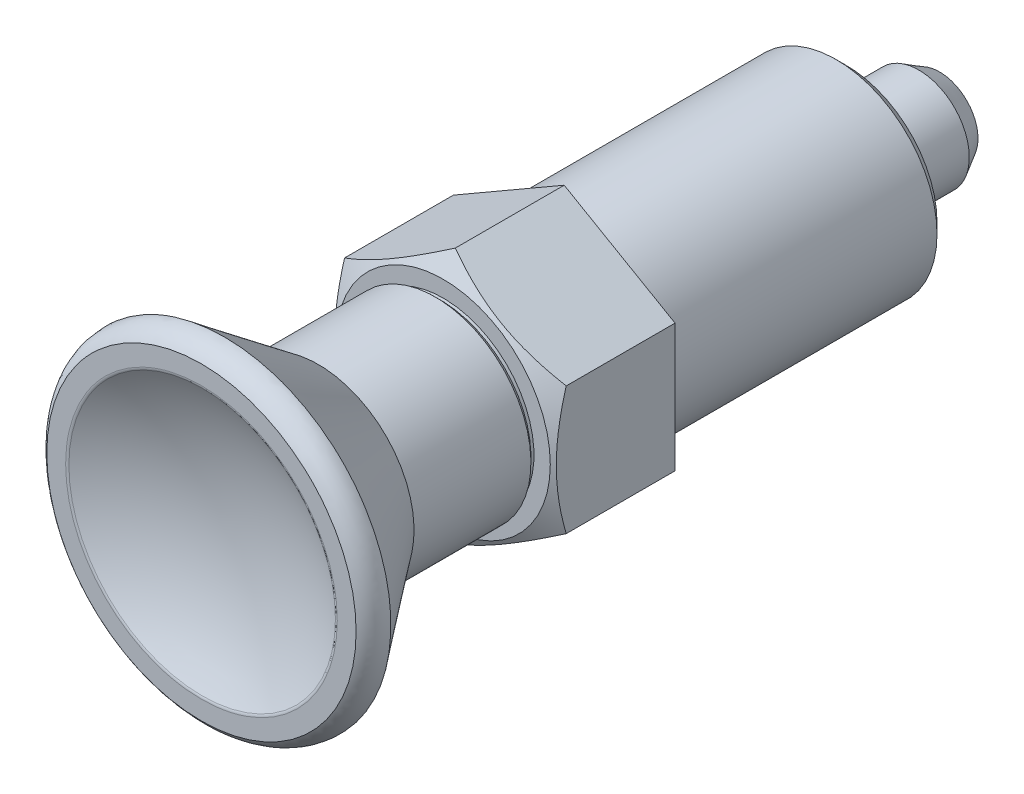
ISO-10303-21;
HEADER;
FILE_DESCRIPTION(('STEP AP214'),'2;1');
FILE_NAME('part.step','',(''),(''),'','','');
FILE_SCHEMA(('AUTOMOTIVE_DESIGN { 1 0 10303 214 1 1 1 1 }'));
ENDSEC;
DATA;
#1=APPLICATION_CONTEXT('core data for automotive mechanical design processes');
#2=APPLICATION_PROTOCOL_DEFINITION('international standard','automotive_design',2000,#1);
#3=PRODUCT_CONTEXT('',#1,'mechanical');
#4=PRODUCT('Part','Part','',(#3));
#5=PRODUCT_RELATED_PRODUCT_CATEGORY('part','',(#4));
#6=PRODUCT_DEFINITION_FORMATION('','',#4);
#7=PRODUCT_DEFINITION_CONTEXT('part definition',#1,'design');
#8=PRODUCT_DEFINITION('design','',#6,#7);
#9=PRODUCT_DEFINITION_SHAPE('','',#8);
#10=(LENGTH_UNIT() NAMED_UNIT(*) SI_UNIT(.MILLI.,.METRE.));
#11=(NAMED_UNIT(*) PLANE_ANGLE_UNIT() SI_UNIT($,.RADIAN.));
#12=(NAMED_UNIT(*) SI_UNIT($,.STERADIAN.) SOLID_ANGLE_UNIT());
#13=UNCERTAINTY_MEASURE_WITH_UNIT(LENGTH_MEASURE(1.E-05),#10,'distance_accuracy_value','');
#14=(GEOMETRIC_REPRESENTATION_CONTEXT(3) GLOBAL_UNCERTAINTY_ASSIGNED_CONTEXT((#13)) GLOBAL_UNIT_ASSIGNED_CONTEXT((#10,
#11,#12)) REPRESENTATION_CONTEXT('',''));
#15=CARTESIAN_POINT('',(0.,0.,0.));
#16=DIRECTION('',(0.,0.,1.));
#17=DIRECTION('',(1.,0.,0.));
#18=AXIS2_PLACEMENT_3D('',#15,#16,#17);
#19=CARTESIAN_POINT('',(5.85947441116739,5.85947441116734,-28.));
#20=DIRECTION('',(0.,0.,-1.));
#21=DIRECTION('',(0.,-1.,0.));
#22=AXIS2_PLACEMENT_3D('',#19,#20,#21);
#23=PLANE('',#22);
#24=CARTESIAN_POINT('',(0.,0.,-28.));
#25=DIRECTION('',(0.,0.,1.));
#26=DIRECTION('',(0.,-1.,0.));
#27=AXIS2_PLACEMENT_3D('',#24,#25,#26);
#28=CIRCLE('',#27,5.1);
#29=CARTESIAN_POINT('',(0.,-5.1000000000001,-28.));
#30=VERTEX_POINT('',#29);
#31=EDGE_CURVE('E126',#30,#30,#28,.T.);
#32=ORIENTED_EDGE('',*,*,#31,.T.);
#33=EDGE_LOOP('',(#32));
#34=FACE_BOUND('',#33,.T.);
#35=CARTESIAN_POINT('',(0.,0.,-28.));
#36=DIRECTION('',(0.,0.,1.));
#37=DIRECTION('',(1.,0.,0.));
#38=AXIS2_PLACEMENT_3D('',#35,#36,#37);
#39=CIRCLE('',#38,9.);
#40=CARTESIAN_POINT('',(8.99999999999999,0.,-28.));
#41=VERTEX_POINT('',#40);
#42=EDGE_CURVE('E363',#41,#41,#39,.T.);
#43=ORIENTED_EDGE('',*,*,#42,.F.);
#44=EDGE_LOOP('',(#43));
#45=FACE_BOUND('',#44,.T.);
#46=ADVANCED_FACE('F16',(#34,#45),#23,.T.);
#47=CARTESIAN_POINT('',(0.,-5.1000000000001,-28.));
#48=CARTESIAN_POINT('',(0.,-4.90000000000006,-27.9999999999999));
#49=CARTESIAN_POINT('',(0.,-4.90000000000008,-28.2));
#50=CARTESIAN_POINT('',(-8.83345911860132,-5.1000000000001,-28.));
#51=CARTESIAN_POINT('',(-8.48704895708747,-4.90000000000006,-28.));
#52=CARTESIAN_POINT('',(-8.4870489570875,-4.90000000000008,-28.2));
#53=CARTESIAN_POINT('',(-4.41672955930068,2.5499999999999,-28.));
#54=CARTESIAN_POINT('',(-4.24352447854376,2.44999999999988,-27.9999999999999));
#55=CARTESIAN_POINT('',(-4.24352447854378,2.44999999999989,-28.2));
#56=CARTESIAN_POINT('',(0.,10.2,-28.));
#57=CARTESIAN_POINT('',(0.,9.79999999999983,-28.));
#58=CARTESIAN_POINT('',(0.,9.79999999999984,-28.2));
#59=CARTESIAN_POINT('',(4.41672955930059,2.5499999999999,-28.));
#60=CARTESIAN_POINT('',(4.24352447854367,2.44999999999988,-27.9999999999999));
#61=CARTESIAN_POINT('',(4.24352447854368,2.44999999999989,-28.2));
#62=CARTESIAN_POINT('',(8.83345911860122,-5.1000000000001,-28.));
#63=CARTESIAN_POINT('',(8.48704895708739,-4.90000000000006,-28.));
#64=CARTESIAN_POINT('',(8.48704895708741,-4.90000000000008,-28.2));
#65=CARTESIAN_POINT('',(0.,-5.1000000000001,-28.));
#66=CARTESIAN_POINT('',(0.,-4.90000000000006,-27.9999999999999));
#67=CARTESIAN_POINT('',(0.,-4.90000000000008,-28.2));
#68=(BOUNDED_SURFACE() B_SPLINE_SURFACE(2,2,((#47,#48,#49),(#50,#51,#52),(#53,#54,#55),(#56,#57,
#58),(#59,#60,#61),(#62,#63,#64),(#65,#66,#67)),.UNSPECIFIED.,.T.,.F.,
.F.) B_SPLINE_SURFACE_WITH_KNOTS((3,2,2,3),(3,3),(0.,42.9425507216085,85.885101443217,
128.827652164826),(0.,1.),
.UNSPECIFIED.) GEOMETRIC_REPRESENTATION_ITEM() RATIONAL_B_SPLINE_SURFACE(((1.,0.707106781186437,
1.),(0.5,0.353553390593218,0.5),(1.,0.707106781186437,1.),(0.5,0.353553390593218,0.5),(1.,
0.707106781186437,1.),(0.5,0.353553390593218,0.5),(1.,0.707106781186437,1.))) REPRESENTATION_ITEM('') SURFACE());
#69=CARTESIAN_POINT('',(0.,-1.00613961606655E-13,-28.2));
#70=DIRECTION('',(0.,0.,1.));
#71=DIRECTION('',(0.,-1.,0.));
#72=AXIS2_PLACEMENT_3D('',#69,#70,#71);
#73=CIRCLE('',#72,4.9);
#74=CARTESIAN_POINT('',(0.,-4.90000000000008,-28.2));
#75=VERTEX_POINT('',#74);
#76=EDGE_CURVE('E508',#75,#75,#73,.T.);
#77=CARTESIAN_POINT('',(0.,-5.1000000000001,-28.));
#78=CARTESIAN_POINT('',(0.,-5.09852014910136,-27.9999999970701));
#79=CARTESIAN_POINT('',(0.,-5.09704029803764,-28.000016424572));
#80=CARTESIAN_POINT('',(0.,-5.09406802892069,-28.0000824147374));
#81=CARTESIAN_POINT('',(0.,-5.09257561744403,-28.0001322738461));
#82=CARTESIAN_POINT('',(0.,-5.08957919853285,-28.0002659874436));
#83=CARTESIAN_POINT('',(0.,-5.088075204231,-28.0003501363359));
#84=CARTESIAN_POINT('',(0.,-5.08505664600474,-28.0005532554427));
#85=CARTESIAN_POINT('',(0.,-5.08354210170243,-28.0006725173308));
#86=CARTESIAN_POINT('',(0.,-5.08050352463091,-28.0009466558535));
#87=CARTESIAN_POINT('',(0.,-5.07897951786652,-28.0011018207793));
#88=CARTESIAN_POINT('',(0.,-5.07592315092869,-28.0014485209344));
#89=CARTESIAN_POINT('',(0.,-5.07439082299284,-28.0016403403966));
#90=CARTESIAN_POINT('',(0.,-5.07131900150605,-28.0020610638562));
#91=CARTESIAN_POINT('',(0.,-5.06977954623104,-28.0022902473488));
#92=CARTESIAN_POINT('',(0.,-5.06669470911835,-28.0027863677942));
#93=CARTESIAN_POINT('',(0.,-5.06514937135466,-28.0030535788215));
#94=CARTESIAN_POINT('',(0.,-5.0620540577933,-28.0036263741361));
#95=CARTESIAN_POINT('',(0.,-5.06050413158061,-28.003932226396));
#96=CARTESIAN_POINT('',(0.,-5.05740097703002,-28.0045828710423));
#97=CARTESIAN_POINT('',(0.,-5.05584780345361,-28.0049279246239));
#98=CARTESIAN_POINT('',(0.,-5.05273953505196,-28.0056574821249));
#99=CARTESIAN_POINT('',(0.,-5.05118449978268,-28.006042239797));
#100=CARTESIAN_POINT('',(0.,-5.04807393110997,-28.0068516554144));
#101=CARTESIAN_POINT('',(0.,-5.04651846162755,-28.0072765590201));
#102=CARTESIAN_POINT('',(0.,-5.0434084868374,-28.0081666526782));
#103=CARTESIAN_POINT('',(0.,-5.04185404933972,-28.0086320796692));
#104=CARTESIAN_POINT('',(0.,-5.03874763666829,-28.0096035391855));
#105=CARTESIAN_POINT('',(0.,-5.03719573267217,-28.0101097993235));
#106=CARTESIAN_POINT('',(0.,-5.03409591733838,-28.011163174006));
#107=CARTESIAN_POINT('',(0.,-5.03254807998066,-28.0117105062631));
#108=CARTESIAN_POINT('',(0.,-5.02945795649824,-28.0128462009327));
#109=CARTESIAN_POINT('',(0.,-5.02791574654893,-28.0134347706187));
#110=CARTESIAN_POINT('',(0.,-5.02483846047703,-28.0146530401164));
#111=CARTESIAN_POINT('',(0.,-5.02330346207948,-28.0152829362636));
#112=CARTESIAN_POINT('',(0.,-5.0202422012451,-28.0165838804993));
#113=CARTESIAN_POINT('',(0.,-5.01871601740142,-28.017255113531));
#114=CARTESIAN_POINT('',(0.,-5.01567400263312,-28.0186386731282));
#115=CARTESIAN_POINT('',(0.,-5.01415825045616,-28.0193511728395));
#116=CARTESIAN_POINT('',(0.,-5.01113872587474,-28.0208171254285));
#117=CARTESIAN_POINT('',(0.,-5.00963503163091,-28.0215707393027));
#118=CARTESIAN_POINT('',(0.,-5.00664125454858,-28.0231186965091));
#119=CARTESIAN_POINT('',(0.,-5.00515124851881,-28.0239131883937));
#120=CARTESIAN_POINT('',(0.,-5.00218647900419,-28.0255425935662));
#121=CARTESIAN_POINT('',(0.,-5.00071179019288,-28.0263776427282));
#122=CARTESIAN_POINT('',(0.,-4.99777928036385,-28.0280877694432));
#123=CARTESIAN_POINT('',(0.,-4.99632153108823,-28.0289629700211));
#124=CARTESIAN_POINT('',(0.,-4.99342451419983,-28.0307529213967));
#125=CARTESIAN_POINT('',(0.,-4.99198531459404,-28.0316677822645));
#126=CARTESIAN_POINT('',(0.,-4.989126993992,-28.0335364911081));
#127=CARTESIAN_POINT('',(0.,-4.98770793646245,-28.0344904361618));
#128=CARTESIAN_POINT('',(0.,-4.98489147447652,-28.0364366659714));
#129=CARTESIAN_POINT('',(0.,-4.98349412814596,-28.0374290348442));
#130=CARTESIAN_POINT('',(0.,-4.9807226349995,-28.039451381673));
#131=CARTESIAN_POINT('',(0.,-4.97934854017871,-28.0404814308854));
#132=CARTESIAN_POINT('',(0.,-4.97662506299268,-28.0425783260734));
#133=CARTESIAN_POINT('',(0.,-4.97527572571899,-28.0436452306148));
#134=CARTESIAN_POINT('',(0.,-4.97260323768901,-28.045814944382));
#135=CARTESIAN_POINT('',(0.,-4.97128012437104,-28.0469177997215));
#136=CARTESIAN_POINT('',(0.,-4.96866151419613,-28.04915844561));
#137=CARTESIAN_POINT('',(0.,-4.96736604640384,-28.0502962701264));
#138=CARTESIAN_POINT('',(0.,-4.96480410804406,-28.05260581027));
#139=CARTESIAN_POINT('',(0.,-4.96353765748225,-28.0537775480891));
#140=CARTESIAN_POINT('',(0.,-4.96103508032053,-28.0561537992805));
#141=CARTESIAN_POINT('',(0.,-4.95979896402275,-28.0573583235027));
#142=CARTESIAN_POINT('',(0.,-4.9573583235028,-28.0597989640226));
#143=CARTESIAN_POINT('',(0.,-4.95615379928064,-28.0610350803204));
#144=CARTESIAN_POINT('',(0.,-4.95377754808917,-28.0635376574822));
#145=CARTESIAN_POINT('',(0.,-4.95260581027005,-28.064804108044));
#146=CARTESIAN_POINT('',(0.,-4.95029627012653,-28.0673660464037));
#147=CARTESIAN_POINT('',(0.,-4.94915844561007,-28.068661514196));
#148=CARTESIAN_POINT('',(0.,-4.94691779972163,-28.0712801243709));
#149=CARTESIAN_POINT('',(0.,-4.94581494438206,-28.0726032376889));
#150=CARTESIAN_POINT('',(0.,-4.94364523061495,-28.0752757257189));
#151=CARTESIAN_POINT('',(0.,-4.94257832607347,-28.0766250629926));
#152=CARTESIAN_POINT('',(0.,-4.94048143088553,-28.0793485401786));
#153=CARTESIAN_POINT('',(0.,-4.9394513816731,-28.0807226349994));
#154=CARTESIAN_POINT('',(0.,-4.93742903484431,-28.0834941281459));
#155=CARTESIAN_POINT('',(0.,-4.93643666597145,-28.0848914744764));
#156=CARTESIAN_POINT('',(0.,-4.93449043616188,-28.0877079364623));
#157=CARTESIAN_POINT('',(0.,-4.93353649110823,-28.0891269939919));
#158=CARTESIAN_POINT('',(0.,-4.93166778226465,-28.0919853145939));
#159=CARTESIAN_POINT('',(0.,-4.93075292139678,-28.0934245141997));
#160=CARTESIAN_POINT('',(0.,-4.92896297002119,-28.0963215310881));
#161=CARTESIAN_POINT('',(0.,-4.92808776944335,-28.0977792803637));
#162=CARTESIAN_POINT('',(0.,-4.92637764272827,-28.1007117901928));
#163=CARTESIAN_POINT('',(0.,-4.92554259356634,-28.1021864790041));
#164=CARTESIAN_POINT('',(0.,-4.92391318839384,-28.1051512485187));
#165=CARTESIAN_POINT('',(0.,-4.9231186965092,-28.1066412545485));
#166=CARTESIAN_POINT('',(0.,-4.92157073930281,-28.1096350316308));
#167=CARTESIAN_POINT('',(0.,-4.92081712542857,-28.1111387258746));
#168=CARTESIAN_POINT('',(0.,-4.91935117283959,-28.1141582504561));
#169=CARTESIAN_POINT('',(0.,-4.91863867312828,-28.115674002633));
#170=CARTESIAN_POINT('',(0.,-4.91725511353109,-28.1187160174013));
#171=CARTESIAN_POINT('',(0.,-4.91658388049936,-28.120242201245));
#172=CARTESIAN_POINT('',(0.,-4.91528293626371,-28.1233034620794));
#173=CARTESIAN_POINT('',(0.,-4.91465304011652,-28.1248384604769));
#174=CARTESIAN_POINT('',(0.,-4.91343477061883,-28.1279157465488));
#175=CARTESIAN_POINT('',(0.,-4.91284620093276,-28.1294579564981));
#176=CARTESIAN_POINT('',(0.,-4.9117105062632,-28.1325480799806));
#177=CARTESIAN_POINT('',(0.,-4.9111631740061,-28.1340959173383));
#178=CARTESIAN_POINT('',(0.,-4.91010979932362,-28.1371957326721));
#179=CARTESIAN_POINT('',(0.,-4.90960353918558,-28.1387476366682));
#180=CARTESIAN_POINT('',(0.,-4.90863207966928,-28.1418540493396));
#181=CARTESIAN_POINT('',(0.,-4.90816665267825,-28.1434084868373));
#182=CARTESIAN_POINT('',(0.,-4.90727655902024,-28.1465184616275));
#183=CARTESIAN_POINT('',(0.,-4.90685165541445,-28.1480739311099));
#184=CARTESIAN_POINT('',(0.,-4.90604223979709,-28.1511844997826));
#185=CARTESIAN_POINT('',(0.,-4.90565748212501,-28.1527395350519));
#186=CARTESIAN_POINT('',(0.,-4.90492792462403,-28.1558478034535));
#187=CARTESIAN_POINT('',(0.,-4.90458287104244,-28.1574009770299));
#188=CARTESIAN_POINT('',(0.,-4.90393222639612,-28.1605041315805));
#189=CARTESIAN_POINT('',(0.,-4.90362637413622,-28.1620540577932));
#190=CARTESIAN_POINT('',(0.,-4.90305357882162,-28.1651493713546));
#191=CARTESIAN_POINT('',(0.,-4.90278636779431,-28.1666947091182));
#192=CARTESIAN_POINT('',(0.,-4.90229024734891,-28.1697795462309));
#193=CARTESIAN_POINT('',(0.,-4.90206106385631,-28.1713190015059));
#194=CARTESIAN_POINT('',(0.,-4.90164034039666,-28.1743908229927));
#195=CARTESIAN_POINT('',(0.,-4.90144852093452,-28.1759231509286));
#196=CARTESIAN_POINT('',(0.,-4.90110182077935,-28.1789795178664));
#197=CARTESIAN_POINT('',(0.,-4.90094665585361,-28.1805035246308));
#198=CARTESIAN_POINT('',(0.,-4.90067251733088,-28.1835421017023));
#199=CARTESIAN_POINT('',(0.,-4.90055325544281,-28.1850566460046));
#200=CARTESIAN_POINT('',(0.,-4.90035013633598,-28.1880752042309));
#201=CARTESIAN_POINT('',(0.,-4.90026598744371,-28.1895791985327));
#202=CARTESIAN_POINT('',(0.,-4.90013227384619,-28.1925756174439));
#203=CARTESIAN_POINT('',(0.,-4.90008241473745,-28.1940680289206));
#204=CARTESIAN_POINT('',(0.,-4.90001642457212,-28.1970402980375));
#205=CARTESIAN_POINT('',(0.,-4.89999999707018,-28.1985201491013));
#206=CARTESIAN_POINT('',(0.,-4.90000000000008,-28.2));
#207=B_SPLINE_CURVE_WITH_KNOTS('',3,(#77,#78,#79,#80,#81,#82,#83,#84,#85,#86,#87,#88,#89,#90,
#91,#92,#93,#94,#95,#96,#97,#98,#99,#100,#101,#102,#103,#104,#105,#106,#107,#108,#109,#110,#111,
#112,#113,#114,#115,#116,#117,#118,#119,#120,#121,#122,#123,#124,#125,#126,#127,#128,#129,#130,
#131,#132,#133,#134,#135,#136,#137,#138,#139,#140,#141,#142,#143,#144,#145,#146,#147,#148,#149,
#150,#151,#152,#153,#154,#155,#156,#157,#158,#159,#160,#161,#162,#163,#164,#165,#166,#167,#168,
#169,#170,#171,#172,#173,#174,#175,#176,#177,#178,#179,#180,#181,#182,#183,#184,#185,#186,#187,
#188,#189,#190,#191,#192,#193,#194,#195,#196,#197,#198,#199,#200,#201,#202,#203,#204,#205,#206),
.UNSPECIFIED.,.F.,.F.,(4,2,2,2,2,2,2,2,2,2,2,2,2,2,2,2,2,2,2,2,2,2,2,2,2,2,2,2,2,2,2,2,2,2,2,2,
2,2,2,2,2,2,2,2,2,2,2,2,2,2,2,2,2,2,2,2,2,2,2,2,2,2,2,2,4),(0.,0.0044394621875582,
0.00891881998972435,0.0134374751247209,0.0179947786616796,0.0225900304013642,0.0272224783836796,
0.0318913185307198,0.0365956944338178,0.0413346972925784,0.046107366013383,0.0509126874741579,
0.0557495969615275,0.0606169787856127,0.0655136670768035,0.0704384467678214,0.075390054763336,
0.0803671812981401,0.0853684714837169,0.090392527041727,0.0954379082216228,0.100503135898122,
0.105586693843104,0.110687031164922,0.11580256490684,0.120931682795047,0.126072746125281,
0.131224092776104,0.136384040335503,0.141550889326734,0.146722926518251,0.151898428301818,
0.157075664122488,0.162252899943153,0.167428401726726,0.172600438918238,0.177767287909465,
0.182927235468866,0.188078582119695,0.193219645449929,0.198348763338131,0.203464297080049,
0.208564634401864,0.213648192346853,0.21871342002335,0.223758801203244,0.228782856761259,
0.233784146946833,0.238761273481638,0.243712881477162,0.248637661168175,0.25353434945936,
0.25840173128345,0.263238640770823,0.268043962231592,0.272816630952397,0.277555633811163,
0.282260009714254,0.286928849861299,0.291561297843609,0.296156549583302,0.300713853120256,
0.305232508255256,0.309711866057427,0.314151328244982),.UNSPECIFIED.);
#208=EDGE_CURVE('BSEAM460',#30,#75,#207,.T.);
#209=ORIENTED_EDGE('',*,*,#31,.F.);
#210=ORIENTED_EDGE('',*,*,#76,.T.);
#211=ORIENTED_EDGE('',*,*,#208,.T.);
#212=ORIENTED_EDGE('',*,*,#208,.F.);
#213=EDGE_LOOP('',(#209,#211,#210,#212));
#214=FACE_BOUND('',#213,.T.);
#215=ADVANCED_FACE('F460',(#214),#68,.T.);
#216=CARTESIAN_POINT('',(0.,0.,-28.2));
#217=DIRECTION('',(0.,0.,-1.));
#218=DIRECTION('',(0.,-1.,0.));
#219=AXIS2_PLACEMENT_3D('',#216,#217,#218);
#220=CYLINDRICAL_SURFACE('',#219,4.9);
#221=CARTESIAN_POINT('',(0.,-4.90000000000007,-28.2732050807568));
#222=CARTESIAN_POINT('',(-0.0711882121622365,-4.89999979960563,-28.2732050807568));
#223=CARTESIAN_POINT('',(-0.14237556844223,-4.89843529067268,-28.2732050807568));
#224=CARTESIAN_POINT('',(-0.28464236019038,-4.89219913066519,-28.2732050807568));
#225=CARTESIAN_POINT('',(-0.355721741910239,-4.8875262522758,-28.2732050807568));
#226=CARTESIAN_POINT('',(-0.497631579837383,-4.87509296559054,-28.2732050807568));
#227=CARTESIAN_POINT('',(-0.568461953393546,-4.86733161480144,-28.2732050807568));
#228=CARTESIAN_POINT('',(-0.709733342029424,-4.84874066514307,-28.2732050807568));
#229=CARTESIAN_POINT('',(-0.780174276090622,-4.83791045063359,-28.2732050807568));
#230=CARTESIAN_POINT('',(-0.920526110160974,-4.81320089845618,-28.2732050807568));
#231=CARTESIAN_POINT('',(-0.990436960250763,-4.79932127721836,-28.2732050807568));
#232=CARTESIAN_POINT('',(-1.12958815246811,-4.76853274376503,-28.2732050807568));
#233=CARTESIAN_POINT('',(-1.19882849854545,-4.75162384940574,-28.2732050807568));
#234=CARTESIAN_POINT('',(-1.33649748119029,-4.71479389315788,-28.2732050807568));
#235=CARTESIAN_POINT('',(-1.40492618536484,-4.69487308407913,-28.2732050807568));
#236=CARTESIAN_POINT('',(-1.5408352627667,-4.6520467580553,-28.2732050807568));
#237=CARTESIAN_POINT('',(-1.60831573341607,-4.62914155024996,-28.2732050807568));
#238=CARTESIAN_POINT('',(-1.74220755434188,-4.58040884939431,-28.2732050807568));
#239=CARTESIAN_POINT('',(-1.80861897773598,-4.55458155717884,-28.2732050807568));
#240=CARTESIAN_POINT('',(-1.94025122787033,-4.50006186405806,-28.2732050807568));
#241=CARTESIAN_POINT('',(-2.00547211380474,-4.47136960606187,-28.2732050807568));
#242=CARTESIAN_POINT('',(-2.13460216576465,-4.41117850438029,-28.2732050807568));
#243=CARTESIAN_POINT('',(-2.19851138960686,-4.37967978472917,-28.2732050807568));
#244=CARTESIAN_POINT('',(-2.32489669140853,-4.31393359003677,-28.2732050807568));
#245=CARTESIAN_POINT('',(-2.38737282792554,-4.2796862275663,-28.2732050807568));
#246=CARTESIAN_POINT('',(-2.51077129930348,-4.2085017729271,-28.2732050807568));
#247=CARTESIAN_POINT('',(-2.57169367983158,-4.17156475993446,-28.2732050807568));
#248=CARTESIAN_POINT('',(-2.69186116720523,-4.09505591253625,-28.2732050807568));
#249=CARTESIAN_POINT('',(-2.75110627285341,-4.05548407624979,-28.2732050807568));
#250=CARTESIAN_POINT('',(-2.86780757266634,-3.97378070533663,-28.2732050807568));
#251=CARTESIAN_POINT('',(-2.92526369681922,-3.93164907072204,-28.2732050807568));
#252=CARTESIAN_POINT('',(-3.03828897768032,-3.84492124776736,-28.2732050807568));
#253=CARTESIAN_POINT('',(-3.09385804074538,-3.80032493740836,-28.2732050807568));
#254=CARTESIAN_POINT('',(-3.20300824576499,-3.70875855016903,-28.2732050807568));
#255=CARTESIAN_POINT('',(-3.25658931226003,-3.6617883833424,-28.2732050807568));
#256=CARTESIAN_POINT('',(-3.36166334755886,-3.56556621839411,-28.2732050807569));
#257=CARTESIAN_POINT('',(-3.41315628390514,-3.51631418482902,-28.2732050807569));
#258=CARTESIAN_POINT('',(-3.51395338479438,-3.41561969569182,-28.2732050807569));
#259=CARTESIAN_POINT('',(-3.56325756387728,-3.36417725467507,-28.2732050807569));
#260=CARTESIAN_POINT('',(-3.65957753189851,-3.25919418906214,-28.2732050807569));
#261=CARTESIAN_POINT('',(-3.70659336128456,-3.20565360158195,-28.2732050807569));
#262=CARTESIAN_POINT('',(-3.79823326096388,-3.09656371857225,-28.2732050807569));
#263=CARTESIAN_POINT('',(-3.84285734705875,-3.0410144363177,-28.2732050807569));
#264=CARTESIAN_POINT('',(-3.92963514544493,-2.92801724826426,-28.2732050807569));
#265=CARTESIAN_POINT('',(-3.97178880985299,-2.8705693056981,-28.2732050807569));
#266=CARTESIAN_POINT('',(-4.05355592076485,-2.75389090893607,-28.2732050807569));
#267=CARTESIAN_POINT('',(-4.09316929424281,-2.69466040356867,-28.2732050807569));
#268=CARTESIAN_POINT('',(-4.16978379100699,-2.57453132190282,-28.2732050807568));
#269=CARTESIAN_POINT('',(-4.20678484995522,-2.51363270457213,-28.2732050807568));
#270=CARTESIAN_POINT('',(-4.27810323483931,-2.39028224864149,-28.2732050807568));
#271=CARTESIAN_POINT('',(-4.31242051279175,-2.32783038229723,-28.2732050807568));
#272=CARTESIAN_POINT('',(-4.37829963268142,-2.2014881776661,-28.2732050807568));
#273=CARTESIAN_POINT('',(-4.40986142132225,-2.13759781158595,-28.2732050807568));
#274=CARTESIAN_POINT('',(-4.47015814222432,-2.00849333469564,-28.2732050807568));
#275=CARTESIAN_POINT('',(-4.49889296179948,-1.94327917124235,-28.2732050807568));
#276=CARTESIAN_POINT('',(-4.55346341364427,-1.81164241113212,-28.2732050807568));
#277=CARTESIAN_POINT('',(-4.57929879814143,-1.74521971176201,-28.2732050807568));
#278=CARTESIAN_POINT('',(-4.62804125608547,-1.61129995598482,-28.2732050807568));
#279=CARTESIAN_POINT('',(-4.65094798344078,-1.5438027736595,-28.2732050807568));
#280=CARTESIAN_POINT('',(-4.693804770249,-1.40786784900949,-28.2732050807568));
#281=CARTESIAN_POINT('',(-4.71375448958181,-1.33942999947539,-28.2732050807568));
#282=CARTESIAN_POINT('',(-4.75066856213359,-1.2017475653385,-28.2732050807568));
#283=CARTESIAN_POINT('',(-4.76763265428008,-1.13250291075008,-28.2732050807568));
#284=CARTESIAN_POINT('',(-4.79854673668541,-0.993340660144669,-28.2732050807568));
#285=CARTESIAN_POINT('',(-4.81249658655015,-0.923423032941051,-28.2732050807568));
#286=CARTESIAN_POINT('',(-4.83735349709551,-0.783048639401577,-28.2732050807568));
#287=CARTESIAN_POINT('',(-4.84826054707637,-0.71259187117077,-28.2732050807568));
#288=CARTESIAN_POINT('',(-4.86700276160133,-0.571272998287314,-28.2732050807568));
#289=CARTESIAN_POINT('',(-4.87483802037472,-0.500410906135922,-28.2732050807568));
#290=CARTESIAN_POINT('',(-4.88740908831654,-0.358415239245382,-28.2732050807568));
#291=CARTESIAN_POINT('',(-4.89214503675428,-0.287281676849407,-28.2732050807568));
#292=CARTESIAN_POINT('',(-4.89848435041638,-0.144876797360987,-28.2732050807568));
#293=CARTESIAN_POINT('',(-4.90008780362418,-0.0736054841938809,-28.2732050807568));
#294=CARTESIAN_POINT('',(-4.90015364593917,0.0689397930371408,-28.2732050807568));
#295=CARTESIAN_POINT('',(-4.89861597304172,0.140213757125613,-28.2732050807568));
#296=CARTESIAN_POINT('',(-4.89242711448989,0.282629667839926,-28.2732050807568));
#297=CARTESIAN_POINT('',(-4.88777577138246,0.353771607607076,-28.2732050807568));
#298=CARTESIAN_POINT('',(-4.87538010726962,0.495789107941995,-28.2732050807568));
#299=CARTESIAN_POINT('',(-4.86763562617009,0.566664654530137,-28.2732050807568));
#300=CARTESIAN_POINT('',(-4.84907597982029,0.708014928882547,-28.2732050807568));
#301=CARTESIAN_POINT('',(-4.83826071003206,0.778489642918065,-28.2732050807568));
#302=CARTESIAN_POINT('',(-4.81358120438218,0.918903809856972,-28.2732050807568));
#303=CARTESIAN_POINT('',(-4.79971694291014,0.988843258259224,-28.2732050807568));
#304=CARTESIAN_POINT('',(-4.76896137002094,1.12805247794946,-28.2732050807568));
#305=CARTESIAN_POINT('',(-4.75207010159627,1.19732225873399,-28.2732050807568));
#306=CARTESIAN_POINT('',(-4.71528207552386,1.33505756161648,-28.2732050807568));
#307=CARTESIAN_POINT('',(-4.69538538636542,1.40352310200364,-28.2732050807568));
#308=CARTESIAN_POINT('',(-4.65260936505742,1.53951594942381,-28.2732050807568));
#309=CARTESIAN_POINT('',(-4.62973005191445,1.60704326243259,-28.2732050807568));
#310=CARTESIAN_POINT('',(-4.58100714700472,1.74102332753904,-28.2732050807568));
#311=CARTESIAN_POINT('',(-4.55516342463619,1.80747603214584,-28.2732050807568));
#312=CARTESIAN_POINT('',(-4.50057903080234,1.93918790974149,-28.2732050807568));
#313=CARTESIAN_POINT('',(-4.47183807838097,2.00444696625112,-28.2732050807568));
#314=CARTESIAN_POINT('',(-4.41153403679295,2.13365634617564,-28.2732050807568));
#315=CARTESIAN_POINT('',(-4.37997063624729,2.19760652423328,-28.2732050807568));
#316=CARTESIAN_POINT('',(-4.31409436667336,2.32408196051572,-28.2732050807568));
#317=CARTESIAN_POINT('',(-4.27978124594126,2.38660708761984,-28.2732050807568));
#318=CARTESIAN_POINT('',(-4.20847866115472,2.51011644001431,-28.2732050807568));
#319=CARTESIAN_POINT('',(-4.17148905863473,2.57110058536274,-28.2732050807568));
#320=CARTESIAN_POINT('',(-4.09490642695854,2.69141187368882,-28.2732050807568));
#321=CARTESIAN_POINT('',(-4.05531339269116,2.75073901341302,-28.2732050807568));
#322=CARTESIAN_POINT('',(-3.97359688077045,2.86762022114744,-28.2732050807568));
#323=CARTESIAN_POINT('',(-3.93147352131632,2.92517437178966,-28.2732050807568));
#324=CARTESIAN_POINT('',(-3.84476916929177,3.03839336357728,-28.2732050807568));
#325=CARTESIAN_POINT('',(-3.80018838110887,3.09405836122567,-28.2732050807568));
#326=CARTESIAN_POINT('',(-3.70864266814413,3.20338339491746,-28.2732050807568));
#327=CARTESIAN_POINT('',(-3.66167797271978,3.25704362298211,-28.2732050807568));
#328=CARTESIAN_POINT('',(-3.56543558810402,3.36224137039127,-28.2732050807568));
#329=CARTESIAN_POINT('',(-3.51615807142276,3.41377904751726,-28.2732050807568));
#330=CARTESIAN_POINT('',(-3.41537098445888,3.51462202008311,-28.2732050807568));
#331=CARTESIAN_POINT('',(-3.3638614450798,3.56392734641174,-28.2732050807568));
#332=CARTESIAN_POINT('',(-3.25872791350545,3.66023295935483,-28.2732050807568));
#333=CARTESIAN_POINT('',(-3.20510384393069,3.70723316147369,-28.2732050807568));
#334=CARTESIAN_POINT('',(-3.09585378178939,3.79885165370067,-28.2732050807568));
#335=CARTESIAN_POINT('',(-3.04022768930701,3.84346982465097,-28.2732050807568));
#336=CARTESIAN_POINT('',(-2.92708734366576,3.93024841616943,-28.2732050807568));
#337=CARTESIAN_POINT('',(-2.86957302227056,3.97240874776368,-28.2732050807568));
#338=CARTESIAN_POINT('',(-2.75276957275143,4.05419544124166,-28.2732050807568));
#339=CARTESIAN_POINT('',(-2.6934804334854,4.09382178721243,-28.2732050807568));
#340=CARTESIAN_POINT('',(-2.57324079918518,4.17046437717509,-28.2732050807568));
#341=CARTESIAN_POINT('',(-2.51229035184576,4.20748069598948,-28.2732050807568));
#342=CARTESIAN_POINT('',(-2.38884143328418,4.27882686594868,-28.2732050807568));
#343=CARTESIAN_POINT('',(-2.32634305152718,4.31315687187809,-28.2732050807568));
#344=CARTESIAN_POINT('',(-2.19991197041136,4.3790547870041,-28.2732050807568));
#345=CARTESIAN_POINT('',(-2.13597937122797,4.41062288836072,-28.2732050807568));
#346=CARTESIAN_POINT('',(-2.00679228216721,4.47091871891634,-28.2732050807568));
#347=CARTESIAN_POINT('',(-1.94153786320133,4.49964660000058,-28.2732050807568));
#348=CARTESIAN_POINT('',(-1.80982498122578,4.55419416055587,-28.2732050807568));
#349=CARTESIAN_POINT('',(-1.74336652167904,4.58001384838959,-28.2732050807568));
#350=CARTESIAN_POINT('',(-1.60938120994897,4.62872140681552,-28.2732050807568));
#351=CARTESIAN_POINT('',(-1.54185431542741,4.65160916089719,-28.2732050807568));
#352=CARTESIAN_POINT('',(-1.40586493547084,4.69442386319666,-28.2732050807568));
#353=CARTESIAN_POINT('',(-1.33740240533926,4.7143506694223,-28.2732050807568));
#354=CARTESIAN_POINT('',(-1.19967523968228,4.7512158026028,-28.2732050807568));
#355=CARTESIAN_POINT('',(-1.13041057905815,4.76815403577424,-28.2732050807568));
#356=CARTESIAN_POINT('',(-0.991212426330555,4.79901387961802,-28.2732050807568));
#357=CARTESIAN_POINT('',(-0.921278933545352,4.81293548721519,-28.2732050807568));
#358=CARTESIAN_POINT('',(-0.780876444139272,4.83773405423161,-28.2732050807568));
#359=CARTESIAN_POINT('',(-0.710407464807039,4.84861111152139,-28.2732050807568));
#360=CARTESIAN_POINT('',(-0.569067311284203,4.86729229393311,-28.2732050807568));
#361=CARTESIAN_POINT('',(-0.498196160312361,4.87509659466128,-28.2732050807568));
#362=CARTESIAN_POINT('',(-0.356185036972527,4.88760483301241,-28.2732050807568));
#363=CARTESIAN_POINT('',(-0.285045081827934,4.89230896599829,-28.2732050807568));
#364=CARTESIAN_POINT('',(-0.142629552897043,4.89858642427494,-28.2732050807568));
#365=CARTESIAN_POINT('',(-0.0713539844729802,4.90015987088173,-28.2732050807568));
#366=CARTESIAN_POINT('',(0.0711982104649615,4.90015759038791,-28.2732050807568));
#367=CARTESIAN_POINT('',(0.142474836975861,4.89858180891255,-28.2732050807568));
#368=CARTESIAN_POINT('',(0.284894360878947,4.89231095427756,-28.2732050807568));
#369=CARTESIAN_POINT('',(0.356037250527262,4.88761570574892,-28.2732050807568));
#370=CARTESIAN_POINT('',(0.498055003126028,4.87512959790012,-28.2732050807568));
#371=CARTESIAN_POINT('',(0.568929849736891,4.86733855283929,-28.2732050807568));
#372=CARTESIAN_POINT('',(0.710277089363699,4.8486860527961,-28.2732050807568));
#373=CARTESIAN_POINT('',(0.780749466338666,4.83782447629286,-28.2732050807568));
#374=CARTESIAN_POINT('',(0.921157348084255,4.81305557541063,-28.2732050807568));
#375=CARTESIAN_POINT('',(0.991092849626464,4.79914823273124,-28.2732050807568));
#376=CARTESIAN_POINT('',(1.13029258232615,4.7683126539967,-28.2732050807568));
#377=CARTESIAN_POINT('',(1.1995568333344,4.75138450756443,-28.2732050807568));
#378=CARTESIAN_POINT('',(1.33727948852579,4.71453171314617,-28.2732050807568));
#379=CARTESIAN_POINT('',(1.40573793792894,4.69460723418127,-28.2732050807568));
#380=CARTESIAN_POINT('',(1.54171504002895,4.65178779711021,-28.2732050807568));
#381=CARTESIAN_POINT('',(1.60923375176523,4.62889302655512,-28.2732050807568));
#382=CARTESIAN_POINT('',(1.74319509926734,4.58015313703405,-28.2732050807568));
#383=CARTESIAN_POINT('',(1.80963777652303,4.5543081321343,-28.2732050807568));
#384=CARTESIAN_POINT('',(1.94132066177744,4.49971559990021,-28.2732050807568));
#385=CARTESIAN_POINT('',(2.00656085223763,4.47096803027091,-28.2732050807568));
#386=CARTESIAN_POINT('',(2.13572561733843,4.41064873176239,-28.2732050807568));
#387=CARTESIAN_POINT('',(2.19965013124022,4.3790768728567,-28.2732050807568));
#388=CARTESIAN_POINT('',(2.32606795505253,4.31318081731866,-28.2732050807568));
#389=CARTESIAN_POINT('',(2.38856120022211,4.27885649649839,-28.2732050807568));
#390=CARTESIAN_POINT('',(2.5120015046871,4.20752897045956,-28.2732050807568));
#391=CARTESIAN_POINT('',(2.57294852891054,4.17052570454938,-28.2732050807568));
#392=CARTESIAN_POINT('',(2.69318117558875,4.09391320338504,-28.2732050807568));
#393=CARTESIAN_POINT('',(2.7524668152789,4.05430399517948,-28.2732050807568));
#394=CARTESIAN_POINT('',(2.86926158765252,3.97255271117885,-28.2732050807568));
#395=CARTESIAN_POINT('',(2.92677079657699,3.9304107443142,-28.2732050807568));
#396=CARTESIAN_POINT('',(3.03989724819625,3.84366669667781,-28.2732050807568));
#397=CARTESIAN_POINT('',(3.09551461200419,3.79906477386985,-28.2732050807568));
#398=CARTESIAN_POINT('',(3.2047431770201,3.7074748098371,-28.2732050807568));
#399=CARTESIAN_POINT('',(3.25835450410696,3.6604869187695,-28.2732050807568));
#400=CARTESIAN_POINT('',(3.3634521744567,3.56419460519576,-28.2732050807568));
#401=CARTESIAN_POINT('',(3.41493857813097,3.51489024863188,-28.2732050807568));
#402=CARTESIAN_POINT('',(3.515696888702,3.41406667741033,-28.2732050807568));
#403=CARTESIAN_POINT('',(3.56496874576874,3.36254741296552,-28.2732050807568));
#404=CARTESIAN_POINT('',(3.66121959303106,3.25740595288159,-28.2732050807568));
#405=CARTESIAN_POINT('',(3.70819848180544,3.20378366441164,-28.2732050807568));
#406=CARTESIAN_POINT('',(3.79978226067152,3.09454531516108,-28.2732050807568));
#407=CARTESIAN_POINT('',(3.84438705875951,3.03892917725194,-28.2732050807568));
#408=CARTESIAN_POINT('',(3.93114216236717,2.92581294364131,-28.2732050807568));
#409=CARTESIAN_POINT('',(3.97329242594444,2.86831281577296,-28.2732050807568));
#410=CARTESIAN_POINT('',(4.05505779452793,2.75153823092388,-28.2732050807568));
#411=CARTESIAN_POINT('',(4.09467292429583,2.69226379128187,-28.2732050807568));
#412=CARTESIAN_POINT('',(4.17128715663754,2.57205013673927,-28.2732050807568));
#413=CARTESIAN_POINT('',(4.20828633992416,2.51111097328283,-28.2732050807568));
#414=CARTESIAN_POINT('',(4.27958868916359,2.38767788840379,-28.2732050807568));
#415=CARTESIAN_POINT('',(4.31389195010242,2.32518402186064,-28.2732050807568));
#416=CARTESIAN_POINT('',(4.37971921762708,2.19874986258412,-28.2732050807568));
#417=CARTESIAN_POINT('',(4.41124325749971,2.13480958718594,-28.2732050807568));
#418=CARTESIAN_POINT('',(4.47144161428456,2.00559875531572,-28.2732050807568));
#419=CARTESIAN_POINT('',(4.50011583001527,1.94032815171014,-28.2732050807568));
#420=CARTESIAN_POINT('',(4.55458433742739,1.80859231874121,-28.2732050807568));
#421=CARTESIAN_POINT('',(4.58037846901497,1.7421270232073,-28.2732050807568));
#422=CARTESIAN_POINT('',(4.62905074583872,1.60813432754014,-28.2732050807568));
#423=CARTESIAN_POINT('',(4.65192877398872,1.54060688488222,-28.2732050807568));
#424=CARTESIAN_POINT('',(4.69473421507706,1.40462321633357,-28.2732050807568));
#425=CARTESIAN_POINT('',(4.71466162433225,1.33616698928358,-28.2732050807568));
#426=CARTESIAN_POINT('',(4.75153069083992,1.19845883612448,-28.2732050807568));
#427=CARTESIAN_POINT('',(4.76847249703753,1.12920694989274,-28.2732050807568));
#428=CARTESIAN_POINT('',(4.79933539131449,0.990040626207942,-28.2732050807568));
#429=CARTESIAN_POINT('',(4.81325678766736,0.920126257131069,-28.2732050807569));
#430=CARTESIAN_POINT('',(4.83804348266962,0.779768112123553,-28.2732050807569));
#431=CARTESIAN_POINT('',(4.84890922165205,0.709324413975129,-28.2732050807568));
#432=CARTESIAN_POINT('',(4.86755066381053,0.568040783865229,-28.2732050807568));
#433=CARTESIAN_POINT('',(4.87532687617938,0.497200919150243,-28.2732050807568));
#434=CARTESIAN_POINT('',(4.88775016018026,0.355257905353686,-28.2732050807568));
#435=CARTESIAN_POINT('',(4.89239770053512,0.284154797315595,-28.2732050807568));
#436=CARTESIAN_POINT('',(4.89856862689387,0.141820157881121,-28.2732050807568));
#437=CARTESIAN_POINT('',(4.90009230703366,0.0705886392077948,-28.2732050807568));
#438=CARTESIAN_POINT('',(4.90003042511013,-0.071869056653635,-28.2732050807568));
#439=CARTESIAN_POINT('',(4.89844502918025,-0.143095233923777,-28.2732050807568));
#440=CARTESIAN_POINT('',(4.8921773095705,-0.285408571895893,-28.2732050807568));
#441=CARTESIAN_POINT('',(4.88749509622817,-0.356495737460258,-28.2732050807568));
#442=CARTESIAN_POINT('',(4.87504649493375,-0.498397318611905,-28.2732050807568));
#443=CARTESIAN_POINT('',(4.86728019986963,-0.569211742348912,-28.2732050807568));
#444=CARTESIAN_POINT('',(4.84867660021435,-0.710434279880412,-28.2732050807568));
#445=CARTESIAN_POINT('',(4.83783937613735,-0.780842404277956,-28.2732050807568));
#446=CARTESIAN_POINT('',(4.8131047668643,-0.921118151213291,-28.2732050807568));
#447=CARTESIAN_POINT('',(4.79920742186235,-0.990985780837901,-28.2732050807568));
#448=CARTESIAN_POINT('',(4.76838482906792,-1.13005034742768,-28.2732050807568));
#449=CARTESIAN_POINT('',(4.7514595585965,-1.19924727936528,-28.2732050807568));
#450=CARTESIAN_POINT('',(4.71461752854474,-1.33684159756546,-28.2732050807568));
#451=CARTESIAN_POINT('',(4.6947007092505,-1.40523896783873,-28.2732050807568));
#452=CARTESIAN_POINT('',(4.6519109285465,-1.54110507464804,-28.2732050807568));
#453=CARTESIAN_POINT('',(4.62903787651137,-1.6085737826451,-28.2732050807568));
#454=CARTESIAN_POINT('',(4.58037097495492,-1.74245337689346,-28.2732050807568));
#455=CARTESIAN_POINT('',(4.55457697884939,-1.80886420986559,-28.2732050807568));
#456=CARTESIAN_POINT('',(4.50010457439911,-1.9404995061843,-28.2732050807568));
#457=CARTESIAN_POINT('',(4.47142590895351,-2.00572386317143,-28.2732050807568));
#458=CARTESIAN_POINT('',(4.41121673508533,-2.13485485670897,-28.2732050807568));
#459=CARTESIAN_POINT('',(4.37968579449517,-2.19876129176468,-28.2732050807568));
#460=CARTESIAN_POINT('',(4.31384707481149,-2.32514189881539,-28.2732050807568));
#461=CARTESIAN_POINT('',(4.27953878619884,-2.38761580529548,-28.2732050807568));
#462=CARTESIAN_POINT('',(4.20822765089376,-2.51102011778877,-28.2732050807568));
#463=CARTESIAN_POINT('',(4.17122435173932,-2.57195026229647,-28.2732050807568));
#464=CARTESIAN_POINT('',(4.09460351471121,-2.6921547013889,-28.2732050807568));
#465=CARTESIAN_POINT('',(4.05498564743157,-2.7514287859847,-28.2732050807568));
#466=CARTESIAN_POINT('',(3.9732164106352,-2.86820896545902,-28.2732050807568));
#467=CARTESIAN_POINT('',(3.9310648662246,-2.92571493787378,-28.2732050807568));
#468=CARTESIAN_POINT('',(3.84430892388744,-3.03884671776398,-28.2732050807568));
#469=CARTESIAN_POINT('',(3.79970450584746,-3.09447250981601,-28.2732050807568));
#470=CARTESIAN_POINT('',(3.70812321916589,-3.20373145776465,-28.2732050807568));
#471=CARTESIAN_POINT('',(3.66114645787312,-3.25736470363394,-28.2732050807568));
#472=CARTESIAN_POINT('',(3.56490195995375,-3.36252718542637,-28.2732050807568));
#473=CARTESIAN_POINT('',(3.51563440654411,-3.4140565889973,-28.2732050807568));
#474=CARTESIAN_POINT('',(3.41488588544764,-3.51489596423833,-28.2732050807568));
#475=CARTESIAN_POINT('',(3.36340510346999,-3.56420612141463,-28.2732050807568));
#476=CARTESIAN_POINT('',(3.25832472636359,-3.66051011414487,-28.2732050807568));
#477=CARTESIAN_POINT('',(3.2047252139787,-3.70750403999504,-28.2732050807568));
#478=CARTESIAN_POINT('',(3.09552390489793,-3.79910565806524,-28.2732050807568));
#479=CARTESIAN_POINT('',(3.03992208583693,-3.84371332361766,-28.2732050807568));
#480=CARTESIAN_POINT('',(2.92682779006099,-3.93046773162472,-28.2732050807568));
#481=CARTESIAN_POINT('',(2.86933524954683,-3.97261439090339,-28.2732050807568));
#482=CARTESIAN_POINT('',(2.75257234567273,-4.05437331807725,-28.2732050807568));
#483=CARTESIAN_POINT('',(2.69330191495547,-4.09398548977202,-28.2732050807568));
#484=CARTESIAN_POINT('',(2.57309567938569,-4.17060155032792,-28.2732050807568));
#485=CARTESIAN_POINT('',(2.51215981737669,-4.2076053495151,-28.2732050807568));
#486=CARTESIAN_POINT('',(2.38873529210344,-4.27893097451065,-28.2732050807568));
#487=CARTESIAN_POINT('',(2.32624657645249,-4.31325270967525,-28.2732050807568));
#488=CARTESIAN_POINT('',(2.19982873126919,-4.37914001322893,-28.2732050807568));
#489=CARTESIAN_POINT('',(2.13589953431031,-4.41070545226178,-28.2732050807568));
#490=CARTESIAN_POINT('',(2.00671376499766,-4.47100782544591,-28.2732050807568));
#491=CARTESIAN_POINT('',(1.94145708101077,-4.4997445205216,-28.2732050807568));
#492=CARTESIAN_POINT('',(1.80972754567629,-4.55431018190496,-28.2732050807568));
#493=CARTESIAN_POINT('',(1.74325451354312,-4.5801387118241,-28.2732050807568));
#494=CARTESIAN_POINT('',(1.60922607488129,-4.62885052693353,-28.2732050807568));
#495=CARTESIAN_POINT('',(1.5416704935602,-4.65173333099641,-28.2732050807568));
#496=CARTESIAN_POINT('',(1.40561855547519,-4.69453156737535,-28.2732050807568));
#497=CARTESIAN_POINT('',(1.33712210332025,-4.71444669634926,-28.2732050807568));
#498=CARTESIAN_POINT('',(1.19932852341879,-4.75128320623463,-28.2732050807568));
#499=CARTESIAN_POINT('',(1.13003139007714,-4.76820456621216,-28.2732050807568));
#500=CARTESIAN_POINT('',(0.990776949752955,-4.79902815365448,-28.2732050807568));
#501=CARTESIAN_POINT('',(0.920819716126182,-4.81293071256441,-28.2732050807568));
#502=CARTESIAN_POINT('',(0.780385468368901,-4.83769095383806,-28.2732050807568));
#503=CARTESIAN_POINT('',(0.709908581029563,-4.84854935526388,-28.2732050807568));
#504=CARTESIAN_POINT('',(0.568575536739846,-4.86719556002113,-28.2732050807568));
#505=CARTESIAN_POINT('',(0.497719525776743,-4.87498446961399,-28.2732050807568));
#506=CARTESIAN_POINT('',(0.355768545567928,-4.88746602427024,-28.2732050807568));
#507=CARTESIAN_POINT('',(0.284673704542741,-4.8921601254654,-28.2732050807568));
#508=CARTESIAN_POINT('',(0.142386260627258,-4.89842615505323,-28.2732050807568));
#509=CARTESIAN_POINT('',(0.0711937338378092,-4.89999981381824,-28.2732050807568));
#510=CARTESIAN_POINT('',(0.,-4.90000000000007,-28.2732050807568));
#511=B_SPLINE_CURVE_WITH_KNOTS('',3,(#221,#222,#223,#224,#225,#226,#227,#228,#229,#230,#231,
#232,#233,#234,#235,#236,#237,#238,#239,#240,#241,#242,#243,#244,#245,#246,#247,#248,#249,#250,
#251,#252,#253,#254,#255,#256,#257,#258,#259,#260,#261,#262,#263,#264,#265,#266,#267,#268,#269,
#270,#271,#272,#273,#274,#275,#276,#277,#278,#279,#280,#281,#282,#283,#284,#285,#286,#287,#288,
#289,#290,#291,#292,#293,#294,#295,#296,#297,#298,#299,#300,#301,#302,#303,#304,#305,#306,#307,
#308,#309,#310,#311,#312,#313,#314,#315,#316,#317,#318,#319,#320,#321,#322,#323,#324,#325,#326,
#327,#328,#329,#330,#331,#332,#333,#334,#335,#336,#337,#338,#339,#340,#341,#342,#343,#344,#345,
#346,#347,#348,#349,#350,#351,#352,#353,#354,#355,#356,#357,#358,#359,#360,#361,#362,#363,#364,
#365,#366,#367,#368,#369,#370,#371,#372,#373,#374,#375,#376,#377,#378,#379,#380,#381,#382,#383,
#384,#385,#386,#387,#388,#389,#390,#391,#392,#393,#394,#395,#396,#397,#398,#399,#400,#401,#402,
#403,#404,#405,#406,#407,#408,#409,#410,#411,#412,#413,#414,#415,#416,#417,#418,#419,#420,#421,
#422,#423,#424,#425,#426,#427,#428,#429,#430,#431,#432,#433,#434,#435,#436,#437,#438,#439,#440,
#441,#442,#443,#444,#445,#446,#447,#448,#449,#450,#451,#452,#453,#454,#455,#456,#457,#458,#459,
#460,#461,#462,#463,#464,#465,#466,#467,#468,#469,#470,#471,#472,#473,#474,#475,#476,#477,#478,
#479,#480,#481,#482,#483,#484,#485,#486,#487,#488,#489,#490,#491,#492,#493,#494,#495,#496,#497,
#498,#499,#500,#501,#502,#503,#504,#505,#506,#507,#508,#509,#510),.UNSPECIFIED.,.F.,.F.,(4,2,2,
2,2,2,2,2,2,2,2,2,2,2,2,2,2,2,2,2,2,2,2,2,2,2,2,2,2,2,2,2,2,2,2,2,2,2,2,2,2,2,2,2,2,2,2,2,2,2,2,
2,2,2,2,2,2,2,2,2,2,2,2,2,2,2,2,2,2,2,2,2,2,2,2,2,2,2,2,2,2,2,2,2,2,2,2,2,2,2,2,2,2,2,2,2,2,2,2,
2,2,2,2,2,2,2,2,2,2,2,2,2,2,2,2,2,2,2,2,2,2,2,2,2,2,2,2,2,2,2,2,2,2,2,2,2,2,2,2,2,2,2,2,2,4),
(0.,0.213546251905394,0.427176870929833,0.640872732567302,0.854611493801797,1.06837013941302,
1.28212752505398,1.49586697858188,1.70958430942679,1.92328696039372,2.13697895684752,
2.35066151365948,2.56433532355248,2.77800284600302,2.99167052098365,3.20534654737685,
3.41903316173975,3.6327278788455,3.84642591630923,4.06012253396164,4.27381537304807,
4.48750680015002,4.70120236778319,4.91490407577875,5.12861104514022,5.34232183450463,
5.55603675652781,5.76976019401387,5.98350188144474,6.19726880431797,6.41106029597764,
6.62487047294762,6.83869060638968,7.05251149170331,7.26632581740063,7.48013053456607,
7.69392924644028,7.90773217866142,8.12154592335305,8.33537073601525,8.54920282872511,
8.76303671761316,8.97686756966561,9.19069354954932,9.40451816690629,9.61835220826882,
9.83220700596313,10.0460854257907,10.2599834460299,10.4738925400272,10.6878020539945,
10.9017015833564,11.1155833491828,11.3294445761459,11.5432898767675,11.7571322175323,
11.9709823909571,12.1848432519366,12.3987118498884,12.612581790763,12.8264455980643,
13.0402970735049,13.2541336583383,13.4679588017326,13.6817833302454,13.8956163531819,
14.1094596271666,14.3233096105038,14.5371598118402,14.7510031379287,14.964834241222,
15.1786518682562,15.3924612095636,15.6062742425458,15.8200992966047,16.0339371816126,
16.247783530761,16.4616311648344,16.6754724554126,16.8893016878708,17.1031174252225,
17.316924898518,17.5307354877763,17.7445559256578,17.9583860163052,18.1722209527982,
18.3860536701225,18.5998771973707,18.8136870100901,19.0274833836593,19.2412736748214,
19.4550687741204,19.6688733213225,19.882686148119,20.0965026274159,20.3103170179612,
20.5241248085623,20.7379250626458,20.9517227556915,21.1655280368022,21.3793451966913,
21.5931709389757,21.8069969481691,22.0208122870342,22.2346057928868,22.4483684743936,
22.6620959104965,22.8757913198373,23.0894666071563,23.3031304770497,23.5167867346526,
23.7304365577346,23.9440807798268,24.1577221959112,24.3713652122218,24.5850124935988,
24.7986663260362,25.0123308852,25.226014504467,25.4397305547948,25.653485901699,
25.8672772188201,26.0810955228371,26.2949286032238,26.5087634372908,26.7225886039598,
26.9363966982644,27.150186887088,27.3639687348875,27.5777529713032,27.7915444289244,
28.0053439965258,28.2191509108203,28.4329650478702,28.646789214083,28.8606314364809,
29.0745057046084,29.2884148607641,29.5023458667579,29.7162783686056,29.9301873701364,
30.1440458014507,30.3578270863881,30.5715077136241,30.78506981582),.UNSPECIFIED.);
#512=CARTESIAN_POINT('',(0.,-4.90000000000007,-28.2732050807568));
#513=VERTEX_POINT('',#512);
#514=EDGE_CURVE('E443',#513,#513,#511,.F.);
#515=ORIENTED_EDGE('',*,*,#514,.T.);
#516=EDGE_LOOP('',(#515));
#517=FACE_BOUND('',#516,.T.);
#518=ORIENTED_EDGE('',*,*,#76,.F.);
#519=EDGE_LOOP('',(#518));
#520=FACE_BOUND('',#519,.T.);
#521=ADVANCED_FACE('F449',(#517,#520),#220,.T.);
#522=CARTESIAN_POINT('',(0.,-4.90000000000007,-28.2732050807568));
#523=CARTESIAN_POINT('',(0.620141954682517,-4.90000000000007,-28.2732050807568));
#524=CARTESIAN_POINT('',(1.86368413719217,-4.66116907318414,-28.2732050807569));
#525=CARTESIAN_POINT('',(3.44077896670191,-3.64883946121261,-28.2732050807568));
#526=CARTESIAN_POINT('',(4.42343929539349,-2.29232188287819,-28.2732050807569));
#527=CARTESIAN_POINT('',(4.87323252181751,-0.899802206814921,-28.2732050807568));
#528=CARTESIAN_POINT('',(4.9505343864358,0.565783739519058,-28.2732050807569));
#529=CARTESIAN_POINT('',(4.51882500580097,2.16996018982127,-28.2732050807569));
#530=CARTESIAN_POINT('',(3.41893635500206,3.6710752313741,-28.2732050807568));
#531=CARTESIAN_POINT('',(1.82600591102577,4.67671674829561,-28.2732050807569));
#532=CARTESIAN_POINT('',(-0.0653024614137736,5.02372308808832,-28.2732050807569));
#533=CARTESIAN_POINT('',(-1.96747776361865,4.62664392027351,-28.2732050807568));
#534=CARTESIAN_POINT('',(-3.62680999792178,3.49579529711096,-28.2732050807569));
#535=CARTESIAN_POINT('',(-4.68948708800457,1.82171793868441,-28.2732050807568));
#536=CARTESIAN_POINT('',(-5.01476285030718,-0.0926330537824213,-28.2732050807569));
#537=CARTESIAN_POINT('',(-4.66106029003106,-1.78917574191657,-28.2732050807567));
#538=CARTESIAN_POINT('',(-3.84362091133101,-3.15286834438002,-28.273205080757));
#539=CARTESIAN_POINT('',(-2.76260718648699,-4.13318027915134,-28.2732050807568));
#540=CARTESIAN_POINT('',(-1.44374847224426,-4.75727890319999,-28.2732050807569));
#541=CARTESIAN_POINT('',(-0.480751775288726,-4.90000000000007,-28.2732050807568));
#542=CARTESIAN_POINT('',(0.,-4.90000000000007,-28.2732050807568));
#543=CARTESIAN_POINT('',(0.,-4.90000000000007,-28.3267949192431));
#544=CARTESIAN_POINT('',(0.620141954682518,-4.90000000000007,-28.3267949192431));
#545=CARTESIAN_POINT('',(1.86368413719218,-4.66116907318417,-28.3267949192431));
#546=CARTESIAN_POINT('',(3.44077896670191,-3.64883946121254,-28.3267949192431));
#547=CARTESIAN_POINT('',(4.42343929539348,-2.29232188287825,-28.3267949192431));
#548=CARTESIAN_POINT('',(4.87323252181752,-0.899802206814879,-28.3267949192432));
#549=CARTESIAN_POINT('',(4.95053438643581,0.565783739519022,-28.3267949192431));
#550=CARTESIAN_POINT('',(4.51882500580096,2.16996018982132,-28.3267949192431));
#551=CARTESIAN_POINT('',(3.41893635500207,3.67107523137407,-28.3267949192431));
#552=CARTESIAN_POINT('',(1.82600591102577,4.67671674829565,-28.3267949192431));
#553=CARTESIAN_POINT('',(-0.0653024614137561,5.0237230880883,-28.3267949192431));
#554=CARTESIAN_POINT('',(-1.96747776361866,4.62664392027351,-28.3267949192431));
#555=CARTESIAN_POINT('',(-3.62680999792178,3.49579529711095,-28.3267949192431));
#556=CARTESIAN_POINT('',(-4.68948708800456,1.82171793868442,-28.3267949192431));
#557=CARTESIAN_POINT('',(-5.01476285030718,-0.0926330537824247,-28.3267949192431));
#558=CARTESIAN_POINT('',(-4.66106029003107,-1.78917574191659,-28.3267949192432));
#559=CARTESIAN_POINT('',(-3.84362091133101,-3.15286834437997,-28.3267949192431));
#560=CARTESIAN_POINT('',(-2.76260718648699,-4.13318027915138,-28.3267949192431));
#561=CARTESIAN_POINT('',(-1.44374847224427,-4.75727890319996,-28.3267949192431));
#562=CARTESIAN_POINT('',(-0.480751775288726,-4.90000000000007,-28.3267949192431));
#563=CARTESIAN_POINT('',(0.,-4.90000000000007,-28.3267949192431));
#564=CARTESIAN_POINT('',(0.,-4.9267949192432,-28.3732050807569));
#565=CARTESIAN_POINT('',(0.623533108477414,-4.9267949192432,-28.3732050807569));
#566=CARTESIAN_POINT('',(1.87387541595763,-4.68665798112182,-28.373205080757));
#567=CARTESIAN_POINT('',(3.459594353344,-3.66879259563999,-28.3732050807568));
#568=CARTESIAN_POINT('',(4.44762821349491,-2.30485710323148,-28.373205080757));
#569=CARTESIAN_POINT('',(4.89988106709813,-0.904722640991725,-28.3732050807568));
#570=CARTESIAN_POINT('',(4.97760564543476,0.568877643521,-28.373205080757));
#571=CARTESIAN_POINT('',(4.54353552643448,2.18182629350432,-28.3732050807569));
#572=CARTESIAN_POINT('',(3.43763229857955,3.69114995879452,-28.3732050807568));
#573=CARTESIAN_POINT('',(1.83599115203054,4.70229067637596,-28.373205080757));
#574=CARTESIAN_POINT('',(-0.0656595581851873,5.0511945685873,-28.3732050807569));
#575=CARTESIAN_POINT('',(-1.97823662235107,4.65194403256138,-28.3732050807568));
#576=CARTESIAN_POINT('',(-3.64664266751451,3.51491153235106,-28.373205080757));
#577=CARTESIAN_POINT('',(-4.7151308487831,1.83167973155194,-28.3732050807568));
#578=CARTESIAN_POINT('',(-5.04218533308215,-0.09313960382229,-28.373205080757));
#579=CARTESIAN_POINT('',(-4.68654860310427,-1.7989595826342,-28.3732050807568));
#580=CARTESIAN_POINT('',(-3.86463917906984,-3.17010933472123,-28.373205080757));
#581=CARTESIAN_POINT('',(-2.77771409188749,-4.15578195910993,-28.3732050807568));
#582=CARTESIAN_POINT('',(-1.45164339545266,-4.78329337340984,-28.3732050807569));
#583=CARTESIAN_POINT('',(-0.48338069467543,-4.9267949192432,-28.3732050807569));
#584=CARTESIAN_POINT('',(0.,-4.9267949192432,-28.3732050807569));
#585=(BOUNDED_SURFACE() B_SPLINE_SURFACE(2,3,((#522,#523,#524,#525,#526,#527,#528,#529,#530,
#531,#532,#533,#534,#535,#536,#537,#538,#539,#540,#541,#542),(#543,#544,#545,#546,#547,#548,
#549,#550,#551,#552,#553,#554,#555,#556,#557,#558,#559,#560,#561,#562,#563),(#564,#565,#566,
#567,#568,#569,#570,#571,#572,#573,#574,#575,#576,#577,#578,#579,#580,#581,#582,#583,#584)),
.UNSPECIFIED.,.F.,.T.,.F.) B_SPLINE_SURFACE_WITH_KNOTS((3,3),(4,1,1,1,1,1,1,1,1,1,1,1,1,1,1,1,1,
1,4),(0.,1.),(2.,20.4908913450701,38.9817826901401,56.8162968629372,69.5182221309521,
82.2201473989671,100.17799371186,118.135840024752,136.693729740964,155.251619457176,
174.345847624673,193.440075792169,213.883544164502,232.067311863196,250.25107956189,
264.585747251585,278.92041494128,293.255082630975,307.58975032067),
.UNSPECIFIED.) GEOMETRIC_REPRESENTATION_ITEM() RATIONAL_B_SPLINE_SURFACE(((1.,1.,1.,1.,1.,1.,1.,
1.,1.,1.,1.,1.,1.,1.,1.,1.,1.,1.,1.,1.,1.),(0.965925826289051,0.965925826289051,
0.965925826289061,0.965925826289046,0.965925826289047,0.96592582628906,0.965925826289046,
0.965925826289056,0.965925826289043,0.965925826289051,0.965925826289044,0.965925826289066,
0.965925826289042,0.965925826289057,0.96592582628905,0.965925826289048,0.965925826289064,
0.965925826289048,0.965925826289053,0.965925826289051,0.965925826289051),(1.,1.,1.,1.,1.,1.,1.,
1.,1.,1.,1.,1.,1.,1.,1.,1.,1.,1.,1.,1.,1.))) REPRESENTATION_ITEM('') SURFACE());
#586=CARTESIAN_POINT('',(0.,-4.92679491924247,-28.3732050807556));
#587=CARTESIAN_POINT('',(0.623533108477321,-4.92679491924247,-28.3732050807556));
#588=CARTESIAN_POINT('',(1.87387541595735,-4.68665798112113,-28.3732050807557));
#589=CARTESIAN_POINT('',(3.45959435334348,-3.66879259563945,-28.3732050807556));
#590=CARTESIAN_POINT('',(4.44762821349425,-2.30485710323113,-28.3732050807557));
#591=CARTESIAN_POINT('',(4.8998810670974,-0.904722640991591,-28.3732050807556));
#592=CARTESIAN_POINT('',(4.97760564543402,0.568877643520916,-28.3732050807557));
#593=CARTESIAN_POINT('',(4.54353552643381,2.181826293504,-28.3732050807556));
#594=CARTESIAN_POINT('',(3.43763229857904,3.69114995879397,-28.3732050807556));
#595=CARTESIAN_POINT('',(1.83599115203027,4.70229067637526,-28.3732050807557));
#596=CARTESIAN_POINT('',(-0.0656595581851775,5.05119456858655,-28.3732050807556));
#597=CARTESIAN_POINT('',(-1.97823662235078,4.65194403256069,-28.3732050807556));
#598=CARTESIAN_POINT('',(-3.64664266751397,3.51491153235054,-28.3732050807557));
#599=CARTESIAN_POINT('',(-4.7151308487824,1.83167973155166,-28.3732050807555));
#600=CARTESIAN_POINT('',(-5.0421853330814,-0.0931396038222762,-28.3732050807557));
#601=CARTESIAN_POINT('',(-4.68654860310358,-1.79895958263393,-28.3732050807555));
#602=CARTESIAN_POINT('',(-3.86463917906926,-3.17010933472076,-28.3732050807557));
#603=CARTESIAN_POINT('',(-2.77771409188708,-4.15578195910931,-28.3732050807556));
#604=CARTESIAN_POINT('',(-1.45164339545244,-4.78329337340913,-28.3732050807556));
#605=CARTESIAN_POINT('',(-0.483380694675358,-4.92679491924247,-28.3732050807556));
#606=CARTESIAN_POINT('',(0.,-4.92679491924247,-28.3732050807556));
#607=(BOUNDED_CURVE() B_SPLINE_CURVE(3,(#586,#587,#588,#589,#590,#591,#592,#593,#594,#595,#596,
#597,#598,#599,#600,#601,#602,#603,#604,#605,#606),.UNSPECIFIED.,.T.,
.F.) B_SPLINE_CURVE_WITH_KNOTS((4,1,1,1,1,1,1,1,1,1,1,1,1,1,1,1,1,1,4),(2.,20.4908913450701,
38.9817826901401,56.8162968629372,69.5182221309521,82.2201473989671,100.17799371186,
118.135840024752,136.693729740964,155.251619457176,174.345847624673,193.440075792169,
213.883544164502,232.067311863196,250.25107956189,264.585747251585,278.92041494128,
293.255082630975,307.58975032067),
.UNSPECIFIED.) CURVE() GEOMETRIC_REPRESENTATION_ITEM() RATIONAL_B_SPLINE_CURVE((0.999999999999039,
0.999999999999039,0.999999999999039,0.999999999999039,0.999999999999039,0.999999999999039,
0.999999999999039,0.999999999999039,0.999999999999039,0.999999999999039,0.999999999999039,
0.999999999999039,0.999999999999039,0.999999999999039,0.999999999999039,0.999999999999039,
0.999999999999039,0.999999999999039,0.999999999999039,0.999999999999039,0.999999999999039)) REPRESENTATION_ITEM(''));
#608=CARTESIAN_POINT('',(0.,-4.92679491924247,-28.3732050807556));
#609=VERTEX_POINT('',#608);
#610=EDGE_CURVE('E492',#609,#609,#607,.F.);
#611=ORIENTED_EDGE('',*,*,#610,.F.);
#612=EDGE_LOOP('',(#611));
#613=FACE_BOUND('',#612,.T.);
#614=ORIENTED_EDGE('',*,*,#514,.F.);
#615=EDGE_LOOP('',(#614));
#616=FACE_BOUND('',#615,.T.);
#617=ADVANCED_FACE('F459',(#613,#616),#585,.T.);
#618=CARTESIAN_POINT('',(0.,-1.01350855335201E-13,-28.3685640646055));
#619=DIRECTION('',(0.,0.,-1.));
#620=DIRECTION('',(0.,-1.,0.));
#621=AXIS2_PLACEMENT_3D('',#618,#619,#620);
#622=CONICAL_SURFACE('',#621,4.92411542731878,0.523598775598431);
#623=ORIENTED_EDGE('',*,*,#610,.T.);
#624=EDGE_LOOP('',(#623));
#625=FACE_BOUND('',#624,.T.);
#626=CARTESIAN_POINT('',(0.,0.,-28.5));
#627=DIRECTION('',(0.,0.,1.));
#628=DIRECTION('',(0.,-1.,0.));
#629=AXIS2_PLACEMENT_3D('',#626,#627,#628);
#630=CIRCLE('',#629,5.);
#631=CARTESIAN_POINT('',(0.,-5.0000000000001,-28.5));
#632=VERTEX_POINT('',#631);
#633=EDGE_CURVE('E435',#632,#632,#630,.T.);
#634=ORIENTED_EDGE('',*,*,#633,.T.);
#635=EDGE_LOOP('',(#634));
#636=FACE_BOUND('',#635,.T.);
#637=ADVANCED_FACE('F468',(#625,#636),#622,.T.);
#638=CARTESIAN_POINT('',(0.,-1.00358544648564E-13,-28.5));
#639=DIRECTION('',(0.,0.,-1.));
#640=DIRECTION('',(0.,-1.,0.));
#641=AXIS2_PLACEMENT_3D('',#638,#639,#640);
#642=CYLINDRICAL_SURFACE('',#641,4.99999999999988);
#643=ORIENTED_EDGE('',*,*,#633,.F.);
#644=EDGE_LOOP('',(#643));
#645=FACE_BOUND('',#644,.T.);
#646=CARTESIAN_POINT('',(0.,-1.10154940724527E-13,-35.2));
#647=DIRECTION('',(0.,0.,1.));
#648=DIRECTION('',(0.,-1.,0.));
#649=AXIS2_PLACEMENT_3D('',#646,#647,#648);
#650=CIRCLE('',#649,4.99999999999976);
#651=CARTESIAN_POINT('',(0.,-4.99999999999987,-35.2));
#652=VERTEX_POINT('',#651);
#653=EDGE_CURVE('E428',#652,#652,#650,.T.);
#654=ORIENTED_EDGE('',*,*,#653,.T.);
#655=EDGE_LOOP('',(#654));
#656=FACE_BOUND('',#655,.T.);
#657=ADVANCED_FACE('F422',(#645,#656),#642,.T.);
#658=CARTESIAN_POINT('',(0.,-1.09815237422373E-13,-37.2549576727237));
#659=DIRECTION('',(0.,0.,1.));
#660=DIRECTION('',(0.,-1.,0.));
#661=AXIS2_PLACEMENT_3D('',#658,#659,#660);
#662=CONICAL_SURFACE('',#661,3.81356963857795,0.523598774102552);
#663=ORIENTED_EDGE('',*,*,#653,.F.);
#664=EDGE_LOOP('',(#663));
#665=FACE_BOUND('',#664,.T.);
#666=CARTESIAN_POINT('',(0.,-1.05818132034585E-13,-37.2549576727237));
#667=DIRECTION('',(0.,0.,1.));
#668=DIRECTION('',(0.,-1.,0.));
#669=AXIS2_PLACEMENT_3D('',#666,#667,#668);
#670=CIRCLE('',#669,3.81356963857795);
#671=CARTESIAN_POINT('',(0.,-3.81356963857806,-37.2549576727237));
#672=VERTEX_POINT('',#671);
#673=EDGE_CURVE('E368',#672,#672,#670,.T.);
#674=ORIENTED_EDGE('',*,*,#673,.T.);
#675=EDGE_LOOP('',(#674));
#676=FACE_BOUND('',#675,.T.);
#677=ADVANCED_FACE('F414',(#665,#676),#662,.T.);
#678=CARTESIAN_POINT('',(0.,-0.025872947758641,-27.9998534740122));
#679=DIRECTION('',(1.,1.34179248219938E-12,0.));
#680=DIRECTION('',(1.34179248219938E-12,-1.,0.));
#681=AXIS2_PLACEMENT_3D('',#678,#679,#680);
#682=CIRCLE('',#681,10.0001799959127);
#683=TRIMMED_CURVE('',#682,(PARAMETER_VALUE(-1.57338357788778)),
(PARAMETER_VALUE(1.57338357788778)),.T.,.PARAMETER.);
#684=CARTESIAN_POINT('',(0.,-1.91000067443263E-13,-27.9998534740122));
#685=DIRECTION('',(0.,0.,-1.));
#686=AXIS1_PLACEMENT('',#684,#685);
#687=SURFACE_OF_REVOLUTION('',#683,#686);
#688=ORIENTED_EDGE('',*,*,#673,.F.);
#689=EDGE_LOOP('',(#688));
#690=FACE_BOUND('',#689,.T.);
#691=CARTESIAN_POINT('',(0.,-1.00613961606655E-13,-38.));
#692=VERTEX_POINT('',#691);
#693=VERTEX_LOOP('',#692);
#694=FACE_BOUND('',#693,.T.);
#695=ADVANCED_FACE('F18',(#690,#694),#687,.T.);
#696=CARTESIAN_POINT('',(0.,0.,0.));
#697=DIRECTION('',(0.,0.,-1.));
#698=DIRECTION('',(1.,0.,0.));
#699=AXIS2_PLACEMENT_3D('',#696,#697,#698);
#700=CYLINDRICAL_SURFACE('',#699,10.);
#701=CARTESIAN_POINT('',(0.,0.,-27.));
#702=DIRECTION('',(0.,0.,-1.));
#703=DIRECTION('',(1.,0.,0.));
#704=AXIS2_PLACEMENT_3D('',#701,#702,#703);
#705=CIRCLE('',#704,10.);
#706=CARTESIAN_POINT('',(10.,0.,-27.));
#707=VERTEX_POINT('',#706);
#708=EDGE_CURVE('E364',#707,#707,#705,.T.);
#709=ORIENTED_EDGE('',*,*,#708,.F.);
#710=EDGE_LOOP('',(#709));
#711=FACE_BOUND('',#710,.T.);
#712=CARTESIAN_POINT('',(0.,0.,0.));
#713=DIRECTION('',(0.,0.,-1.));
#714=DIRECTION('',(1.,0.,0.));
#715=AXIS2_PLACEMENT_3D('',#712,#713,#714);
#716=CIRCLE('',#715,10.);
#717=CARTESIAN_POINT('',(10.,0.,0.));
#718=VERTEX_POINT('',#717);
#719=EDGE_CURVE('E359',#718,#718,#716,.T.);
#720=ORIENTED_EDGE('',*,*,#719,.T.);
#721=EDGE_LOOP('',(#720));
#722=FACE_BOUND('',#721,.T.);
#723=ADVANCED_FACE('F272',(#711,#722),#700,.T.);
#724=CARTESIAN_POINT('',(0.,0.,-28.));
#725=DIRECTION('',(0.,0.,1.));
#726=DIRECTION('',(1.,0.,0.));
#727=AXIS2_PLACEMENT_3D('',#724,#725,#726);
#728=CONICAL_SURFACE('',#727,9.,0.78539816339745);
#729=ORIENTED_EDGE('',*,*,#708,.T.);
#730=EDGE_LOOP('',(#729));
#731=FACE_BOUND('',#730,.T.);
#732=ORIENTED_EDGE('',*,*,#42,.T.);
#733=EDGE_LOOP('',(#732));
#734=FACE_BOUND('',#733,.T.);
#735=ADVANCED_FACE('F271',(#731,#734),#728,.T.);
#736=CARTESIAN_POINT('',(-13.97,13.97,0.));
#737=DIRECTION('',(0.,0.,-1.));
#738=DIRECTION('',(1.,0.,0.));
#739=AXIS2_PLACEMENT_3D('',#736,#737,#738);
#740=PLANE('',#739);
#741=CARTESIAN_POINT('',(0.,12.7008529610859,0.));
#742=DIRECTION('',(0.866025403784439,-0.5,0.));
#743=VECTOR('',#742,1.);
#744=LINE('',#741,#743);
#745=CARTESIAN_POINT('',(0.,12.7008529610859,0.));
#746=VERTEX_POINT('',#745);
#747=CARTESIAN_POINT('',(10.9992613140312,6.35042648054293,0.));
#748=VERTEX_POINT('',#747);
#749=EDGE_CURVE('E258',#746,#748,#744,.T.);
#750=ORIENTED_EDGE('',*,*,#749,.T.);
#751=CARTESIAN_POINT('',(10.9992613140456,6.35042648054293,0.));
#752=DIRECTION('',(0.,-1.,0.));
#753=VECTOR('',#752,1.);
#754=LINE('',#751,#753);
#755=CARTESIAN_POINT('',(10.9992613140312,-6.35042648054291,0.));
#756=VERTEX_POINT('',#755);
#757=EDGE_CURVE('E45',#748,#756,#754,.T.);
#758=ORIENTED_EDGE('',*,*,#757,.T.);
#759=CARTESIAN_POINT('',(10.9992613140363,-6.35042648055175,0.));
#760=DIRECTION('',(-0.866025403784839,-0.499999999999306,0.));
#761=VECTOR('',#760,1.);
#762=LINE('',#759,#761);
#763=CARTESIAN_POINT('',(0.,-12.7008529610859,0.));
#764=VERTEX_POINT('',#763);
#765=EDGE_CURVE('E877',#756,#764,#762,.T.);
#766=ORIENTED_EDGE('',*,*,#765,.T.);
#767=CARTESIAN_POINT('',(0.,-12.7008529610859,0.));
#768=DIRECTION('',(-0.866025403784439,0.5,0.));
#769=VECTOR('',#768,1.);
#770=LINE('',#767,#769);
#771=CARTESIAN_POINT('',(-10.9992613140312,-6.35042648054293,0.));
#772=VERTEX_POINT('',#771);
#773=EDGE_CURVE('E234',#764,#772,#770,.T.);
#774=ORIENTED_EDGE('',*,*,#773,.T.);
#775=CARTESIAN_POINT('',(-10.9992613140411,-6.35042648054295,0.));
#776=DIRECTION('',(0.,1.,0.));
#777=VECTOR('',#776,1.);
#778=LINE('',#775,#777);
#779=CARTESIAN_POINT('',(-10.9992613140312,6.35042648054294,0.));
#780=VERTEX_POINT('',#779);
#781=EDGE_CURVE('E307',#772,#780,#778,.T.);
#782=ORIENTED_EDGE('',*,*,#781,.T.);
#783=CARTESIAN_POINT('',(-10.9992613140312,6.35042648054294,0.));
#784=DIRECTION('',(0.866025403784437,0.500000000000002,0.));
#785=VECTOR('',#784,1.);
#786=LINE('',#783,#785);
#787=EDGE_CURVE('E337',#780,#746,#786,.T.);
#788=ORIENTED_EDGE('',*,*,#787,.T.);
#789=EDGE_LOOP('',(#750,#758,#766,#774,#782,#788));
#790=FACE_BOUND('',#789,.T.);
#791=ORIENTED_EDGE('',*,*,#719,.F.);
#792=EDGE_LOOP('',(#791));
#793=FACE_BOUND('',#792,.T.);
#794=ADVANCED_FACE('F138',(#790,#793),#740,.T.);
#795=CARTESIAN_POINT('',(11.,-6.35085296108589,12.));
#796=DIRECTION('',(-1.,0.,0.));
#797=DIRECTION('',(0.,1.,0.));
#798=AXIS2_PLACEMENT_3D('',#795,#796,#797);
#799=PLANE('',#798);
#800=DIRECTION('',(0.,0.,1.));
#801=VECTOR('',#800,1.);
#802=CARTESIAN_POINT('',(11.,-6.35085296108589,0.));
#803=LINE('',#802,#801);
#804=CARTESIAN_POINT('',(10.9992613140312,-6.35042648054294,10.8));
#805=VERTEX_POINT('',#804);
#806=EDGE_CURVE('E221',#756,#805,#803,.T.);
#807=ORIENTED_EDGE('',*,*,#806,.F.);
#808=ORIENTED_EDGE('',*,*,#757,.F.);
#809=DIRECTION('',(0.,0.,1.));
#810=VECTOR('',#809,1.);
#811=CARTESIAN_POINT('',(11.,6.35085296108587,0.));
#812=LINE('',#811,#810);
#813=CARTESIAN_POINT('',(10.9992613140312,6.3504264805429,10.8));
#814=VERTEX_POINT('',#813);
#815=EDGE_CURVE('E113',#748,#814,#812,.T.);
#816=ORIENTED_EDGE('',*,*,#815,.T.);
#817=CARTESIAN_POINT('',(11.,0.,11.7814954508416));
#818=CARTESIAN_POINT('',(10.9998885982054,0.25009017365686,11.781594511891));
#819=CARTESIAN_POINT('',(10.9996652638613,0.500179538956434,11.7767657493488));
#820=CARTESIAN_POINT('',(10.9992524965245,0.998995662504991,11.7573916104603));
#821=CARTESIAN_POINT('',(10.9990629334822,1.24772390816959,11.7428845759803));
#822=CARTESIAN_POINT('',(10.998970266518,1.7460234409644,11.7041683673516));
#823=CARTESIAN_POINT('',(10.9990690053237,1.9955899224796,11.6798976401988));
#824=CARTESIAN_POINT('',(10.9993069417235,2.49769679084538,11.6217985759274));
#825=CARTESIAN_POINT('',(10.9994467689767,2.7502198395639,11.5878217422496));
#826=CARTESIAN_POINT('',(10.9994246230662,3.27696721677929,11.5077592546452));
#827=CARTESIAN_POINT('',(10.999233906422,3.55106616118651,11.4608508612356));
#828=CARTESIAN_POINT('',(10.9989589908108,4.10139621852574,11.3566572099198));
#829=CARTESIAN_POINT('',(10.9988763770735,4.3776005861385,11.2992312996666));
#830=CARTESIAN_POINT('',(10.9988410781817,4.9339897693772,11.1741004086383));
#831=CARTESIAN_POINT('',(10.9988912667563,5.21412997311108,11.1061985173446));
#832=CARTESIAN_POINT('',(10.9990062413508,5.78003493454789,10.9601520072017));
#833=CARTESIAN_POINT('',(10.9990713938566,6.06574000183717,10.8817754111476));
#834=CARTESIAN_POINT('',(10.9990766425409,6.35031986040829,10.7996306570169));
#835=B_SPLINE_CURVE_WITH_KNOTS('',3,(#817,#818,#819,#820,#821,#822,#823,#824,#825,#826,#827,
#828,#829,#830,#831,#832,#833,#834),.UNSPECIFIED.,.F.,.F.,(4,2,2,2,2,2,2,2,4),(0.,
0.750218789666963,1.49748299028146,2.2495338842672,3.01377082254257,3.84783756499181,
4.69400292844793,5.55862752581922,6.44724949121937),.UNSPECIFIED.);
#836=CARTESIAN_POINT('',(11.,0.,11.7814954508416));
#837=VERTEX_POINT('',#836);
#838=EDGE_CURVE('E100',#837,#814,#835,.T.);
#839=ORIENTED_EDGE('',*,*,#838,.F.);
#840=CARTESIAN_POINT('',(10.9990766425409,-6.35031986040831,10.7996306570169));
#841=CARTESIAN_POINT('',(10.9990714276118,-6.06574588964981,10.8817737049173));
#842=CARTESIAN_POINT('',(10.9990068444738,-5.78004668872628,10.9601484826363));
#843=CARTESIAN_POINT('',(10.9988932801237,-5.21414934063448,11.106192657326));
#844=CARTESIAN_POINT('',(10.998843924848,-4.93401085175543,11.1740939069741));
#845=CARTESIAN_POINT('',(10.9988804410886,-4.37762130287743,11.2992247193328));
#846=CARTESIAN_POINT('',(10.9989634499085,-4.10141482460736,11.3566510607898));
#847=CARTESIAN_POINT('',(10.9992371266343,-3.55107719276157,11.4608472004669));
#848=CARTESIAN_POINT('',(10.999426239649,-3.27697275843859,11.5077575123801));
#849=CARTESIAN_POINT('',(10.9994452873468,-2.75022556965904,11.5878216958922));
#850=CARTESIAN_POINT('',(10.9993039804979,-2.4977082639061,11.621798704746));
#851=CARTESIAN_POINT('',(10.9990649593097,-1.99560903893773,11.6798979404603));
#852=CARTESIAN_POINT('',(10.9989665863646,-1.74604444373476,11.704168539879));
#853=CARTESIAN_POINT('',(10.999060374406,-1.24774489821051,11.7428847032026));
#854=CARTESIAN_POINT('',(10.9992506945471,-0.999014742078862,11.7573916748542));
#855=CARTESIAN_POINT('',(10.9996647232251,-0.500190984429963,11.776765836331));
#856=CARTESIAN_POINT('',(10.999888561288,-0.250095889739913,11.7815945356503));
#857=CARTESIAN_POINT('',(11.,0.,11.7814954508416));
#858=B_SPLINE_CURVE_WITH_KNOTS('',3,(#840,#841,#842,#843,#844,#845,#846,#847,#848,#849,#850,
#851,#852,#853,#854,#855,#856,#857),.UNSPECIFIED.,.F.,.F.,(4,2,2,2,2,2,2,2,4),(0.,
0.888603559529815,1.75322270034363,2.59939455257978,3.43347851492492,4.19769843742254,
4.94974363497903,5.69701354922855,6.44724950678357),.UNSPECIFIED.);
#859=EDGE_CURVE('E94',#805,#837,#858,.T.);
#860=ORIENTED_EDGE('',*,*,#859,.F.);
#861=EDGE_LOOP('',(#807,#808,#816,#839,#860));
#862=FACE_BOUND('',#861,.T.);
#863=ADVANCED_FACE('F111',(#862),#799,.F.);
#864=CARTESIAN_POINT('',(0.,-12.7017059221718,12.));
#865=DIRECTION('',(-0.5,0.866025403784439,0.));
#866=DIRECTION('',(0.866025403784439,0.5,0.));
#867=AXIS2_PLACEMENT_3D('',#864,#865,#866);
#868=PLANE('',#867);
#869=DIRECTION('',(0.,0.,1.));
#870=VECTOR('',#869,1.);
#871=CARTESIAN_POINT('',(0.,-12.7017059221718,0.));
#872=LINE('',#871,#870);
#873=CARTESIAN_POINT('',(0.,-12.7008529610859,10.8));
#874=VERTEX_POINT('',#873);
#875=EDGE_CURVE('E220',#764,#874,#872,.T.);
#876=ORIENTED_EDGE('',*,*,#875,.F.);
#877=ORIENTED_EDGE('',*,*,#765,.F.);
#878=ORIENTED_EDGE('',*,*,#806,.T.);
#879=CARTESIAN_POINT('',(0.,-12.7006397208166,10.7996306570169));
#880=CARTESIAN_POINT('',(0.246500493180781,-12.5582863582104,10.8818094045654));
#881=CARTESIAN_POINT('',(0.493943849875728,-12.4153154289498,10.960220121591));
#882=CARTESIAN_POINT('',(0.984064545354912,-12.1321354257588,11.1063335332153));
#883=CARTESIAN_POINT('',(1.22669008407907,-11.9919560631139,11.1742682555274));
#884=CARTESIAN_POINT('',(1.70863277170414,-11.713656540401,11.2994634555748));
#885=CARTESIAN_POINT('',(1.94790989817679,-11.5755563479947,11.3569209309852));
#886=CARTESIAN_POINT('',(2.42471184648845,-11.3004858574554,11.4611764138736));
#887=CARTESIAN_POINT('',(2.66221274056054,-11.1635276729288,11.5081152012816));
#888=CARTESIAN_POINT('',(3.11834642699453,-10.9000889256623,11.5882161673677));
#889=CARTESIAN_POINT('',(3.33688465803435,-10.7736968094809,11.6222054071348));
#890=CARTESIAN_POINT('',(3.77144024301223,-10.522422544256,11.680328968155));
#891=CARTESIAN_POINT('',(3.98744222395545,-10.3975484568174,11.704611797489));
#892=CARTESIAN_POINT('',(4.4188605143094,-10.1484545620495,11.7433750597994));
#893=CARTESIAN_POINT('',(4.6342717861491,-10.0242356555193,11.757916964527));
#894=CARTESIAN_POINT('',(5.06631632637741,-9.77519870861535,11.7772995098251));
#895=CARTESIAN_POINT('',(5.28295106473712,-9.65038023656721,11.7821016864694));
#896=CARTESIAN_POINT('',(5.71598365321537,-9.40036679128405,11.7821026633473));
#897=CARTESIAN_POINT('',(5.93238151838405,-9.27517184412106,11.7773021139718));
#898=CARTESIAN_POINT('',(6.36405647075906,-9.02554021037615,11.7579217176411));
#899=CARTESIAN_POINT('',(6.57933464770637,-8.9011024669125,11.7433799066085));
#900=CARTESIAN_POINT('',(7.01076686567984,-8.65203334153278,11.704616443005));
#901=CARTESIAN_POINT('',(7.22691758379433,-8.52740589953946,11.6803328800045));
#902=CARTESIAN_POINT('',(7.66182502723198,-8.27669555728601,11.6222079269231));
#903=CARTESIAN_POINT('',(7.88056701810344,-8.15062191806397,11.5882176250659));
#904=CARTESIAN_POINT('',(8.33678386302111,-7.88730992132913,11.5081177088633));
#905=CARTESIAN_POINT('',(8.57413494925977,-7.75010912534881,11.4611819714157));
#906=CARTESIAN_POINT('',(9.05074284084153,-7.47472582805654,11.3569303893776));
#907=CARTESIAN_POINT('',(9.28997718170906,-7.33655805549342,11.2994735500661));
#908=CARTESIAN_POINT('',(9.77196341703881,-7.05833516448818,11.1742782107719));
#909=CARTESIAN_POINT('',(10.0146779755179,-6.91830475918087,11.1063425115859));
#910=CARTESIAN_POINT('',(10.5049905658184,-6.63543382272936,10.9602255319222));
#911=CARTESIAN_POINT('',(10.7525369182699,-6.49262331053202,10.8818120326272));
#912=CARTESIAN_POINT('',(10.9990766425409,-6.35031986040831,10.7996306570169));
#913=B_SPLINE_CURVE_WITH_KNOTS('',3,(#879,#880,#881,#882,#883,#884,#885,#886,#887,#888,#889,
#890,#891,#892,#893,#894,#895,#896,#897,#898,#899,#900,#901,#902,#903,#904,#905,#906,#907,#908,
#909,#910,#911,#912),.UNSPECIFIED.,.F.,.F.,(4,2,2,2,2,2,2,2,2,2,2,2,2,2,2,2,4),(0.,
0.888859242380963,1.75370932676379,2.60008721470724,3.43435260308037,4.19839418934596,
4.95025200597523,5.69731923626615,6.44733106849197,7.1972921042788,7.94434176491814,
8.69621622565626,9.46030945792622,10.2945483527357,11.1409162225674,12.0057746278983,
12.8946620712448),.UNSPECIFIED.);
#914=EDGE_CURVE('E103',#874,#805,#913,.T.);
#915=ORIENTED_EDGE('',*,*,#914,.F.);
#916=EDGE_LOOP('',(#876,#877,#878,#915));
#917=FACE_BOUND('',#916,.T.);
#918=ADVANCED_FACE('F137',(#917),#868,.F.);
#919=CARTESIAN_POINT('',(-11.,-6.35085296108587,12.));
#920=DIRECTION('',(0.5,0.866025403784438,0.));
#921=DIRECTION('',(0.866025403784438,-0.5,0.));
#922=AXIS2_PLACEMENT_3D('',#919,#920,#921);
#923=PLANE('',#922);
#924=DIRECTION('',(0.,0.,1.));
#925=VECTOR('',#924,1.);
#926=CARTESIAN_POINT('',(-11.,-6.35085296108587,0.));
#927=LINE('',#926,#925);
#928=CARTESIAN_POINT('',(-10.9992613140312,-6.35042648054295,10.8));
#929=VERTEX_POINT('',#928);
#930=EDGE_CURVE('E238',#772,#929,#927,.T.);
#931=ORIENTED_EDGE('',*,*,#930,.F.);
#932=ORIENTED_EDGE('',*,*,#773,.F.);
#933=ORIENTED_EDGE('',*,*,#875,.T.);
#934=CARTESIAN_POINT('',(-10.9990766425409,-6.3503198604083,10.7996306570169));
#935=CARTESIAN_POINT('',(-10.7525447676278,-6.4926188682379,10.8818094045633));
#936=CARTESIAN_POINT('',(-10.505006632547,-6.63542563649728,10.9602201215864));
#937=CARTESIAN_POINT('',(-10.0147052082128,-6.9182926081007,11.1063335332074));
#938=CARTESIAN_POINT('',(-9.77199354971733,-7.05832280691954,11.1742682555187));
#939=CARTESIAN_POINT('',(-9.29000774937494,-7.33654765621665,11.2994634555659));
#940=CARTESIAN_POINT('',(-9.0507709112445,-7.47471763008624,11.356920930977));
#941=CARTESIAN_POINT('',(-8.57415190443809,-7.75010498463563,11.4611764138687));
#942=CARTESIAN_POINT('',(-8.33679219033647,-7.8873077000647,11.5081152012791));
#943=CARTESIAN_POINT('',(-7.8805806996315,-8.15061168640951,11.5882161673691));
#944=CARTESIAN_POINT('',(-7.66185280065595,-8.27667528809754,11.6222054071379));
#945=CARTESIAN_POINT('',(-7.22696511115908,-8.52737433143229,11.6803289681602));
#946=CARTESIAN_POINT('',(-7.01081998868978,-8.65200049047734,11.7046117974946));
#947=CARTESIAN_POINT('',(-6.57938920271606,-8.90107274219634,11.743375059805));
#948=CARTESIAN_POINT('',(-6.36410683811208,-9.02551492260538,11.7579169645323));
#949=CARTESIAN_POINT('',(-5.93241224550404,-9.27515799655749,11.7772995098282));
#950=CARTESIAN_POINT('',(-5.71599890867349,-9.40035994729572,11.7821016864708));
#951=CARTESIAN_POINT('',(-5.28296461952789,-9.65037044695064,11.7821026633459));
#952=CARTESIAN_POINT('',(-5.06634368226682,-9.77517902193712,11.7773021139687));
#953=CARTESIAN_POINT('',(-4.63431886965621,-10.0242046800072,11.7579217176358));
#954=CARTESIAN_POINT('',(-4.41891353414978,-10.1484221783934,11.743379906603));
#955=CARTESIAN_POINT('',(-3.9874972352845,-10.3975188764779,11.7046164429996));
#956=CARTESIAN_POINT('',(-3.77149134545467,-10.5223971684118,11.6803328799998));
#957=CARTESIAN_POINT('',(-3.33691609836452,-10.7736828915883,11.6222079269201));
#958=CARTESIAN_POINT('',(-3.11836212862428,-10.9000821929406,11.5882176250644));
#959=CARTESIAN_POINT('',(-2.66221882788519,-11.1635215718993,11.5081177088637));
#960=CARTESIAN_POINT('',(-2.42472391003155,-11.3004732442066,11.4611819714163));
#961=CARTESIAN_POINT('',(-1.9479310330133,-11.5755361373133,11.3569303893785));
#962=CARTESIAN_POINT('',(-1.70865706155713,-11.7136352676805,11.2994735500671));
#963=CARTESIAN_POINT('',(-1.22671585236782,-11.9919361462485,11.1742782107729));
#964=CARTESIAN_POINT('',(-0.984088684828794,-12.1321179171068,11.1063425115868));
#965=CARTESIAN_POINT('',(-0.493958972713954,-12.4153056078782,10.9602255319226));
#966=CARTESIAN_POINT('',(-0.24650826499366,-12.5582817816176,10.8818120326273));
#967=CARTESIAN_POINT('',(0.,-12.7006397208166,10.7996306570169));
#968=B_SPLINE_CURVE_WITH_KNOTS('',3,(#934,#935,#936,#937,#938,#939,#940,#941,#942,#943,#944,
#945,#946,#947,#948,#949,#950,#951,#952,#953,#954,#955,#956,#957,#958,#959,#960,#961,#962,#963,
#964,#965,#966,#967),.UNSPECIFIED.,.F.,.F.,(4,2,2,2,2,2,2,2,2,2,2,2,2,2,2,2,4),(0.,
0.888859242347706,1.75370932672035,2.6000872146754,3.43435260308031,4.19839418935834,
4.95025200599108,5.69731923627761,6.44733106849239,7.19729210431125,7.94434176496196,
8.69621622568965,9.46030945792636,10.2945483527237,11.1409162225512,12.0057746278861,
12.8946620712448),.UNSPECIFIED.);
#969=EDGE_CURVE('E223',#929,#874,#968,.T.);
#970=ORIENTED_EDGE('',*,*,#969,.F.);
#971=EDGE_LOOP('',(#931,#932,#933,#970));
#972=FACE_BOUND('',#971,.T.);
#973=ADVANCED_FACE('F232',(#972),#923,.F.);
#974=CARTESIAN_POINT('',(-11.,6.35085296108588,12.));
#975=DIRECTION('',(1.,0.,0.));
#976=DIRECTION('',(0.,-1.,0.));
#977=AXIS2_PLACEMENT_3D('',#974,#975,#976);
#978=PLANE('',#977);
#979=DIRECTION('',(0.,0.,1.));
#980=VECTOR('',#979,1.);
#981=CARTESIAN_POINT('',(-11.,6.35085296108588,0.));
#982=LINE('',#981,#980);
#983=CARTESIAN_POINT('',(-10.9992613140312,6.35042648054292,10.8));
#984=VERTEX_POINT('',#983);
#985=EDGE_CURVE('E244',#780,#984,#982,.T.);
#986=ORIENTED_EDGE('',*,*,#985,.F.);
#987=ORIENTED_EDGE('',*,*,#781,.F.);
#988=ORIENTED_EDGE('',*,*,#930,.T.);
#989=CARTESIAN_POINT('',(-10.9990766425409,6.35031986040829,10.7996306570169));
#990=CARTESIAN_POINT('',(-10.9990452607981,6.06566748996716,10.8818094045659));
#991=CARTESIAN_POINT('',(-10.9989504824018,5.77988979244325,10.9602201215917));
#992=CARTESIAN_POINT('',(-10.9987697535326,5.21384281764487,11.1063335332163));
#993=CARTESIAN_POINT('',(-10.9986836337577,4.9336332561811,11.1742682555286));
#994=CARTESIAN_POINT('',(-10.9986405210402,4.37710888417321,11.2994634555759));
#995=CARTESIAN_POINT('',(-10.9986808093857,4.10083871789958,11.3569209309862));
#996=CARTESIAN_POINT('',(-10.9988637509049,3.55038087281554,11.4611764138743));
#997=CARTESIAN_POINT('',(-10.9990049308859,3.27621997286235,11.5081152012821));
#998=CARTESIAN_POINT('',(-10.9989271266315,2.74947723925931,11.5882161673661));
#999=CARTESIAN_POINT('',(-10.9987374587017,2.49702152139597,11.6222054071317));
#1000=CARTESIAN_POINT('',(-10.9984053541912,1.995048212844,11.68032896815));
#1001=CARTESIAN_POINT('',(-10.9982622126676,1.74554796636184,11.7046117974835));
#1002=CARTESIAN_POINT('',(-10.9982497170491,1.2473818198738,11.7433750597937));
#1003=CARTESIAN_POINT('',(-10.9983786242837,0.998720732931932,11.7579169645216));
#1004=CARTESIAN_POINT('',(-10.9987285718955,0.500040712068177,11.7772995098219));
#1005=CARTESIAN_POINT('',(-10.9989499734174,0.250020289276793,11.782101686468));
#1006=CARTESIAN_POINT('',(-10.998948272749,-0.250003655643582,11.7821026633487));
#1007=CARTESIAN_POINT('',(-10.9987252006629,-0.500007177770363,11.7773021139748));
#1008=CARTESIAN_POINT('',(-10.9983753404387,-0.998664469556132,11.7579217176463));
#1009=CARTESIAN_POINT('',(-10.9982481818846,-1.24731971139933,11.743379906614));
#1010=CARTESIAN_POINT('',(-10.9982641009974,-1.74548553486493,11.7046164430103));
#1011=CARTESIAN_POINT('',(-10.9984089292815,-1.9949912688,11.680332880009));
#1012=CARTESIAN_POINT('',(-10.9987411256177,-2.49698733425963,11.6222079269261));
#1013=CARTESIAN_POINT('',(-10.9989291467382,-2.74946027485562,11.5882176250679));
#1014=CARTESIAN_POINT('',(-10.9990026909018,-3.27621165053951,11.5081177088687));
#1015=CARTESIAN_POINT('',(-10.9988588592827,-3.55036411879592,11.4611819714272));
#1016=CARTESIAN_POINT('',(-10.998673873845,-4.10081030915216,11.3569303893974));
#1017=CARTESIAN_POINT('',(-10.9986342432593,-4.3770772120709,11.2994735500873));
#1018=CARTESIAN_POINT('',(-10.9986792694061,-4.93360098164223,11.1742782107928));
#1019=CARTESIAN_POINT('',(-10.9987666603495,-5.21381315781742,11.1063425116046));
#1020=CARTESIAN_POINT('',(-10.9989495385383,-5.77987178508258,10.960225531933));
#1021=CARTESIAN_POINT('',(-10.9990451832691,-6.0656584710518,10.8818120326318));
#1022=CARTESIAN_POINT('',(-10.9990766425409,-6.3503198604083,10.7996306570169));
#1023=B_SPLINE_CURVE_WITH_KNOTS('',3,(#989,#990,#991,#992,#993,#994,#995,#996,#997,#998,#999,
#1000,#1001,#1002,#1003,#1004,#1005,#1006,#1007,#1008,#1009,#1010,#1011,#1012,#1013,#1014,#1015,
#1016,#1017,#1018,#1019,#1020,#1021,#1022),.UNSPECIFIED.,.F.,.F.,(4,2,2,2,2,2,2,2,2,2,2,2,2,2,2,
2,4),(0.,0.888859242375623,1.75370932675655,2.60008721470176,3.43435260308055,4.1983941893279,
4.95025200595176,5.69731923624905,6.4473310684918,7.197292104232,7.94434176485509,
8.69621622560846,9.4603094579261,10.294548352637,11.1409162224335,12.005774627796,
12.8946620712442),.UNSPECIFIED.);
#1024=EDGE_CURVE('E226',#984,#929,#1023,.T.);
#1025=ORIENTED_EDGE('',*,*,#1024,.F.);
#1026=EDGE_LOOP('',(#986,#987,#988,#1025));
#1027=FACE_BOUND('',#1026,.T.);
#1028=ADVANCED_FACE('F311',(#1027),#978,.F.);
#1029=CARTESIAN_POINT('',(0.,12.7017059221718,12.));
#1030=DIRECTION('',(0.5,-0.866025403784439,0.));
#1031=DIRECTION('',(-0.866025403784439,-0.5,0.));
#1032=AXIS2_PLACEMENT_3D('',#1029,#1030,#1031);
#1033=PLANE('',#1032);
#1034=DIRECTION('',(0.,0.,-1.));
#1035=VECTOR('',#1034,1.);
#1036=CARTESIAN_POINT('',(0.,12.7017059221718,10.8));
#1037=LINE('',#1036,#1035);
#1038=CARTESIAN_POINT('',(0.,12.7008529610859,10.8));
#1039=VERTEX_POINT('',#1038);
#1040=EDGE_CURVE('E116',#1039,#746,#1037,.T.);
#1041=ORIENTED_EDGE('',*,*,#1040,.T.);
#1042=ORIENTED_EDGE('',*,*,#787,.F.);
#1043=ORIENTED_EDGE('',*,*,#985,.T.);
#1044=CARTESIAN_POINT('',(0.,12.7006397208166,10.7996306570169));
#1045=CARTESIAN_POINT('',(-0.246500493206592,12.5582863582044,10.8818094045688));
#1046=CARTESIAN_POINT('',(-0.493943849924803,12.4153154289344,10.960220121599));
#1047=CARTESIAN_POINT('',(-0.984064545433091,12.1321354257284,11.1063335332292));
#1048=CARTESIAN_POINT('',(-1.22669008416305,11.9919560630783,11.1742682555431));
#1049=CARTESIAN_POINT('',(-1.70863277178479,11.7136565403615,11.2994634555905));
#1050=CARTESIAN_POINT('',(-1.94790989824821,11.5755563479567,11.3569209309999));
#1051=CARTESIAN_POINT('',(-2.42471184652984,11.3004858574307,11.4611764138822));
#1052=CARTESIAN_POINT('',(-2.66221274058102,11.163527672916,11.5081152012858));
#1053=CARTESIAN_POINT('',(-3.11834642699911,10.9000889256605,11.588216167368));
#1054=CARTESIAN_POINT('',(-3.33688465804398,10.7736968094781,11.6222054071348));
#1055=CARTESIAN_POINT('',(-3.77144024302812,10.522422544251,11.6803289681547));
#1056=CARTESIAN_POINT('',(-3.98744222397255,10.3975484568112,11.7046117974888));
#1057=CARTESIAN_POINT('',(-4.41886051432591,10.1484545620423,11.7433750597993));
#1058=CARTESIAN_POINT('',(-4.63427178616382,10.0242356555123,11.7579169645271));
#1059=CARTESIAN_POINT('',(-5.06631632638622,9.77519870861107,11.7772995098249));
#1060=CARTESIAN_POINT('',(-5.28295106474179,9.65038023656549,11.7821016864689));
#1061=CARTESIAN_POINT('',(-5.7159836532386,9.40036679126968,11.7821026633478));
#1062=CARTESIAN_POINT('',(-5.93238151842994,9.27517184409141,11.7773021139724));
#1063=CARTESIAN_POINT('',(-6.36405647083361,9.02554021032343,11.7579217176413));
#1064=CARTESIAN_POINT('',(-6.57933464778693,8.90110246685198,11.7433799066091));
#1065=CARTESIAN_POINT('',(-7.01076686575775,8.65203334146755,11.7046164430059));
#1066=CARTESIAN_POINT('',(-7.22691758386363,8.52740589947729,11.6803328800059));
#1067=CARTESIAN_POINT('',(-7.66182502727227,8.2766955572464,11.6222079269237));
#1068=CARTESIAN_POINT('',(-7.88056701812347,8.15062191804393,11.5882176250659));
#1069=CARTESIAN_POINT('',(-8.33678386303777,7.88730992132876,11.5081177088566));
#1070=CARTESIAN_POINT('',(-8.57413494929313,7.7501091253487,11.4611819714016));
#1071=CARTESIAN_POINT('',(-9.05074284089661,7.4747258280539,11.356930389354));
#1072=CARTESIAN_POINT('',(-9.28997718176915,7.33655805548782,11.2994735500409));
#1073=CARTESIAN_POINT('',(-9.77196341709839,7.05833516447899,11.174278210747));
#1074=CARTESIAN_POINT('',(-10.014677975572,6.91830475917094,11.1063425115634));
#1075=CARTESIAN_POINT('',(-10.5049905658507,6.63543382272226,10.9602255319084));
#1076=CARTESIAN_POINT('',(-10.7525369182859,6.4926233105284,10.8818120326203));
#1077=CARTESIAN_POINT('',(-10.9990766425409,6.35031986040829,10.7996306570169));
#1078=B_SPLINE_CURVE_WITH_KNOTS('',3,(#1044,#1045,#1046,#1047,#1048,#1049,#1050,#1051,#1052,
#1053,#1054,#1055,#1056,#1057,#1058,#1059,#1060,#1061,#1062,#1063,#1064,#1065,#1066,#1067,#1068,
#1069,#1070,#1071,#1072,#1073,#1074,#1075,#1076,#1077),.UNSPECIFIED.,.F.,.F.,(4,2,2,2,2,2,2,2,2,
2,2,2,2,2,2,2,4),(0.,0.888859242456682,1.75370932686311,2.60008721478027,3.43435260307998,
4.19839418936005,4.95025200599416,5.69731923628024,6.44733106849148,7.19729210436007,
7.94434176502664,8.69621622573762,9.46030945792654,10.2945483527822,11.1409162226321,
12.0057746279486,12.8946620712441),.UNSPECIFIED.);
#1079=EDGE_CURVE('E330',#1039,#984,#1078,.T.);
#1080=ORIENTED_EDGE('',*,*,#1079,.F.);
#1081=EDGE_LOOP('',(#1041,#1042,#1043,#1080));
#1082=FACE_BOUND('',#1081,.T.);
#1083=ADVANCED_FACE('F171',(#1082),#1033,.F.);
#1084=CARTESIAN_POINT('',(11.,6.35085296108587,12.));
#1085=DIRECTION('',(-0.5,-0.866025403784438,0.));
#1086=DIRECTION('',(-0.866025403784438,0.5,0.));
#1087=AXIS2_PLACEMENT_3D('',#1084,#1085,#1086);
#1088=PLANE('',#1087);
#1089=ORIENTED_EDGE('',*,*,#815,.F.);
#1090=ORIENTED_EDGE('',*,*,#749,.F.);
#1091=ORIENTED_EDGE('',*,*,#1040,.F.);
#1092=CARTESIAN_POINT('',(10.9990766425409,6.35031986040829,10.7996306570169));
#1093=CARTESIAN_POINT('',(10.7525447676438,6.49261886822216,10.8818094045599));
#1094=CARTESIAN_POINT('',(10.5050066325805,6.63542563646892,10.9602201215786));
#1095=CARTESIAN_POINT('',(10.0147052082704,6.91829260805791,11.106333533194));
#1096=CARTESIAN_POINT('',(9.77199354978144,7.0583228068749,11.1742682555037));
#1097=CARTESIAN_POINT('',(9.29000774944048,7.33654765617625,11.2994634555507));
#1098=CARTESIAN_POINT('',(9.05077091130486,7.47471763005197,11.3569209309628));
#1099=CARTESIAN_POINT('',(8.574151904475,7.75010498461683,11.4611764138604));
#1100=CARTESIAN_POINT('',(8.33679219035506,7.88730770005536,11.5081152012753));
#1101=CARTESIAN_POINT('',(7.88058069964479,8.15061168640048,11.5882161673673));
#1102=CARTESIAN_POINT('',(7.66185280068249,8.27667528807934,11.622205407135));
#1103=CARTESIAN_POINT('',(7.22696511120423,8.52737433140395,11.6803289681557));
#1104=CARTESIAN_POINT('',(7.01081998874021,8.652000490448,11.7046117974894));
#1105=CARTESIAN_POINT('',(6.57938920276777,8.9010727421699,11.7433750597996));
#1106=CARTESIAN_POINT('',(6.36410683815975,9.02551492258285,11.7579169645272));
#1107=CARTESIAN_POINT('',(5.93241224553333,9.27515799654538,11.7772995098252));
#1108=CARTESIAN_POINT('',(5.71599890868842,9.40035994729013,11.7821016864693));
#1109=CARTESIAN_POINT('',(5.2829646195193,9.65037044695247,11.7821026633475));
#1110=CARTESIAN_POINT('',(5.06634368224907,9.77517902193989,11.7773021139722));
#1111=CARTESIAN_POINT('',(4.63431886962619,10.0242046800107,11.7579217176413));
#1112=CARTESIAN_POINT('',(4.41891353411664,10.1484221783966,11.743379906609));
#1113=CARTESIAN_POINT('',(3.9874972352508,10.3975188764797,11.7046164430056));
#1114=CARTESIAN_POINT('',(3.77149134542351,10.5223971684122,11.6803328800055));
#1115=CARTESIAN_POINT('',(3.33691609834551,10.7736828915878,11.6222079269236));
#1116=CARTESIAN_POINT('',(3.11836212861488,10.9000821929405,11.5882176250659));
#1117=CARTESIAN_POINT('',(2.66221882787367,11.1635215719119,11.5081177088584));
#1118=CARTESIAN_POINT('',(2.42472391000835,11.3004732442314,11.4611819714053));
#1119=CARTESIAN_POINT('',(1.94793103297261,11.5755361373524,11.3569303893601));
#1120=CARTESIAN_POINT('',(1.70865706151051,11.7136352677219,11.2994735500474));
#1121=CARTESIAN_POINT('',(1.22671585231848,11.9919361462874,11.1742782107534));
#1122=CARTESIAN_POINT('',(0.984088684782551,12.1321179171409,11.1063425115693));
#1123=CARTESIAN_POINT('',(0.493958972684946,12.4153056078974,10.960225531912));
#1124=CARTESIAN_POINT('',(0.246508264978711,12.5582817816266,10.8818120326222));
#1125=CARTESIAN_POINT('',(0.,12.7006397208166,10.7996306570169));
#1126=B_SPLINE_CURVE_WITH_KNOTS('',3,(#1092,#1093,#1094,#1095,#1096,#1097,#1098,#1099,#1100,
#1101,#1102,#1103,#1104,#1105,#1106,#1107,#1108,#1109,#1110,#1111,#1112,#1113,#1114,#1115,#1116,
#1117,#1118,#1119,#1120,#1121,#1122,#1123,#1124,#1125),.UNSPECIFIED.,.F.,.F.,(4,2,2,2,2,2,2,2,2,
2,2,2,2,2,2,2,4),(0.,0.888859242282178,1.75370932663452,2.60008721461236,3.43435260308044,
4.19839418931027,4.95025200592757,5.69731923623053,6.44733106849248,7.19729210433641,
7.94434176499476,8.69621622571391,9.46030945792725,10.2945483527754,11.1409162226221,
12.0057746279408,12.8946620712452),.UNSPECIFIED.);
#1127=EDGE_CURVE('E332',#814,#1039,#1126,.T.);
#1128=ORIENTED_EDGE('',*,*,#1127,.F.);
#1129=EDGE_LOOP('',(#1089,#1090,#1091,#1128));
#1130=FACE_BOUND('',#1129,.T.);
#1131=ADVANCED_FACE('F168',(#1130),#1088,.F.);
#1132=CARTESIAN_POINT('',(0.,0.,12.));
#1133=DIRECTION('',(0.,0.,-1.));
#1134=DIRECTION('',(1.,0.,0.));
#1135=AXIS2_PLACEMENT_3D('',#1132,#1133,#1134);
#1136=CONICAL_SURFACE('',#1135,10.6215390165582,1.0471975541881);
#1137=ORIENTED_EDGE('',*,*,#1127,.T.);
#1138=ORIENTED_EDGE('',*,*,#1079,.T.);
#1139=ORIENTED_EDGE('',*,*,#1024,.T.);
#1140=ORIENTED_EDGE('',*,*,#969,.T.);
#1141=ORIENTED_EDGE('',*,*,#914,.T.);
#1142=ORIENTED_EDGE('',*,*,#859,.T.);
#1143=ORIENTED_EDGE('',*,*,#838,.T.);
#1144=EDGE_LOOP('',(#1137,#1138,#1139,#1140,#1141,#1142,#1143));
#1145=FACE_BOUND('',#1144,.T.);
#1146=CARTESIAN_POINT('',(0.,0.,12.));
#1147=DIRECTION('',(0.,0.,1.));
#1148=DIRECTION('',(1.,0.,0.));
#1149=AXIS2_PLACEMENT_3D('',#1146,#1147,#1148);
#1150=CIRCLE('',#1149,10.6215390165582);
#1151=CARTESIAN_POINT('',(10.6215390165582,0.,12.));
#1152=VERTEX_POINT('',#1151);
#1153=EDGE_CURVE('E354',#1152,#1152,#1150,.T.);
#1154=ORIENTED_EDGE('',*,*,#1153,.F.);
#1155=EDGE_LOOP('',(#1154));
#1156=FACE_BOUND('',#1155,.T.);
#1157=ADVANCED_FACE('F98',(#1145,#1156),#1136,.T.);
#1158=CARTESIAN_POINT('',(-11.683692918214,-11.683692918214,12.));
#1159=DIRECTION('',(0.,0.,1.));
#1160=DIRECTION('',(1.,0.,0.));
#1161=AXIS2_PLACEMENT_3D('',#1158,#1159,#1160);
#1162=PLANE('',#1161);
#1163=CARTESIAN_POINT('',(0.,0.,12.));
#1164=DIRECTION('',(0.,0.,1.));
#1165=DIRECTION('',(-1.,0.,0.));
#1166=AXIS2_PLACEMENT_3D('',#1163,#1164,#1165);
#1167=CIRCLE('',#1166,9.);
#1168=CARTESIAN_POINT('',(-9.00000000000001,0.,12.));
#1169=VERTEX_POINT('',#1168);
#1170=EDGE_CURVE('E10',#1169,#1169,#1167,.T.);
#1171=ORIENTED_EDGE('',*,*,#1170,.F.);
#1172=EDGE_LOOP('',(#1171));
#1173=FACE_BOUND('',#1172,.T.);
#1174=ORIENTED_EDGE('',*,*,#1153,.T.);
#1175=EDGE_LOOP('',(#1174));
#1176=FACE_BOUND('',#1175,.T.);
#1177=ADVANCED_FACE('F141',(#1173,#1176),#1162,.T.);
#1178=CARTESIAN_POINT('',(0.,0.,27.));
#1179=DIRECTION('',(0.,0.,-1.));
#1180=DIRECTION('',(1.,0.,0.));
#1181=AXIS2_PLACEMENT_3D('',#1178,#1179,#1180);
#1182=CYLINDRICAL_SURFACE('',#1181,9.);
#1183=ORIENTED_EDGE('',*,*,#1170,.T.);
#1184=EDGE_LOOP('',(#1183));
#1185=FACE_BOUND('',#1184,.T.);
#1186=CARTESIAN_POINT('',(0.,0.,12.3));
#1187=DIRECTION('',(0.,0.,1.));
#1188=DIRECTION('',(-1.,0.,0.));
#1189=AXIS2_PLACEMENT_3D('',#1186,#1187,#1188);
#1190=CIRCLE('',#1189,9.);
#1191=CARTESIAN_POINT('',(-9.00000000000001,0.,12.3));
#1192=VERTEX_POINT('',#1191);
#1193=EDGE_CURVE('E20',#1192,#1192,#1190,.F.);
#1194=ORIENTED_EDGE('',*,*,#1193,.T.);
#1195=EDGE_LOOP('',(#1194));
#1196=FACE_BOUND('',#1195,.T.);
#1197=ADVANCED_FACE('F531',(#1185,#1196),#1182,.T.);
#1198=CARTESIAN_POINT('',(0.,7.21644966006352E-13,58.3153369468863));
#1199=DIRECTION('',(0.,0.,-1.));
#1200=DIRECTION('',(0.,-1.,0.));
#1201=AXIS2_PLACEMENT_3D('',#1198,#1199,#1200);
#1202=SPHERICAL_SURFACE('',#1201,25.9999999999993);
#1203=CARTESIAN_POINT('',(0.,0.,35.9304780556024));
#1204=DIRECTION('',(0.,0.,-1.));
#1205=DIRECTION('',(0.,-1.,0.));
#1206=AXIS2_PLACEMENT_3D('',#1203,#1204,#1205);
#1207=CIRCLE('',#1206,13.2256603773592);
#1208=CARTESIAN_POINT('',(0.,-13.2256603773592,35.9304780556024));
#1209=VERTEX_POINT('',#1208);
#1210=EDGE_CURVE('E372',#1209,#1209,#1207,.T.);
#1211=ORIENTED_EDGE('',*,*,#1210,.F.);
#1212=EDGE_LOOP('',(#1211));
#1213=FACE_BOUND('',#1212,.T.);
#1214=ADVANCED_FACE('F533',(#1213),#1202,.F.);
#1215=CARTESIAN_POINT('',(0.,-13.2256603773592,35.9304780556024));
#1216=CARTESIAN_POINT('',(0.,-13.3433285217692,36.0000000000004));
#1217=CARTESIAN_POINT('',(0.,-13.48,36.0000000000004));
#1218=CARTESIAN_POINT('',(-22.9075157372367,-13.2256603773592,35.9304780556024));
#1219=CARTESIAN_POINT('',(-23.1113229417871,-13.3433285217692,36.0000000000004));
#1220=CARTESIAN_POINT('',(-23.3480448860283,-13.48,36.));
#1221=CARTESIAN_POINT('',(-11.4537578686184,6.61283018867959,35.9304780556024));
#1222=CARTESIAN_POINT('',(-11.5556614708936,6.6716642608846,36.0000000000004));
#1223=CARTESIAN_POINT('',(-11.6740224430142,6.74,36.0000000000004));
#1224=CARTESIAN_POINT('',(0.,26.4513207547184,35.9304780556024));
#1225=CARTESIAN_POINT('',(0.,26.6866570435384,36.0000000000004));
#1226=CARTESIAN_POINT('',(0.,26.96,36.));
#1227=CARTESIAN_POINT('',(11.4537578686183,6.6128301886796,35.9304780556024));
#1228=CARTESIAN_POINT('',(11.5556614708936,6.67166426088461,36.0000000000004));
#1229=CARTESIAN_POINT('',(11.6740224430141,6.74,36.0000000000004));
#1230=CARTESIAN_POINT('',(22.9075157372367,-13.2256603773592,35.9304780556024));
#1231=CARTESIAN_POINT('',(23.1113229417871,-13.3433285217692,36.0000000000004));
#1232=CARTESIAN_POINT('',(23.3480448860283,-13.48,36.));
#1233=CARTESIAN_POINT('',(0.,-13.2256603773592,35.9304780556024));
#1234=CARTESIAN_POINT('',(0.,-13.3433285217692,36.0000000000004));
#1235=CARTESIAN_POINT('',(0.,-13.48,36.0000000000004));
#1236=(BOUNDED_SURFACE() B_SPLINE_SURFACE(2,2,((#1215,#1216,#1217),(#1218,#1219,#1220),(#1221,
#1222,#1223),(#1224,#1225,#1226),(#1227,#1228,#1229),(#1230,#1231,#1232),(#1233,#1234,#1235)),
.UNSPECIFIED.,.T.,.F.,.F.) B_SPLINE_SURFACE_WITH_KNOTS((3,2,2,3),(3,3),(0.,169.162579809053,
338.325159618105,507.487739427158),(0.,1.),
.UNSPECIFIED.) GEOMETRIC_REPRESENTATION_ITEM() RATIONAL_B_SPLINE_SURFACE(((1.,0.964612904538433,
1.),(0.5,0.482306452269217,0.5),(1.,0.964612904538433,1.),(0.5,0.482306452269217,0.5),(1.,
0.964612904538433,1.),(0.5,0.482306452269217,0.5),(1.,0.964612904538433,1.))) REPRESENTATION_ITEM('') SURFACE());
#1237=CARTESIAN_POINT('',(0.,0.,36.0000000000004));
#1238=DIRECTION('',(0.,0.,-1.));
#1239=DIRECTION('',(0.,-1.,0.));
#1240=AXIS2_PLACEMENT_3D('',#1237,#1238,#1239);
#1241=CIRCLE('',#1240,13.48);
#1242=CARTESIAN_POINT('',(0.,-13.48,36.0000000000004));
#1243=VERTEX_POINT('',#1242);
#1244=EDGE_CURVE('E375',#1243,#1243,#1241,.T.);
#1245=CARTESIAN_POINT('',(0.,-13.2256603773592,35.9304780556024));
#1246=CARTESIAN_POINT('',(0.,-13.2280276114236,35.9318766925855));
#1247=CARTESIAN_POINT('',(0.,-13.2304063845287,35.9332557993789));
#1248=CARTESIAN_POINT('',(0.,-13.2351913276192,35.9359774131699));
#1249=CARTESIAN_POINT('',(0.,-13.2375975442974,35.937319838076));
#1250=CARTESIAN_POINT('',(0.,-13.2424365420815,35.9399672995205));
#1251=CARTESIAN_POINT('',(0.,-13.2448693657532,35.9412722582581));
#1252=CARTESIAN_POINT('',(0.,-13.249760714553,35.9438440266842));
#1253=CARTESIAN_POINT('',(0.,-13.25221927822,35.9451107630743));
#1254=CARTESIAN_POINT('',(0.,-13.2571612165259,35.9476053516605));
#1255=CARTESIAN_POINT('',(0.,-13.2596446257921,35.9488331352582));
#1256=CARTESIAN_POINT('',(0.,-13.2646353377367,35.9512491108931));
#1257=CARTESIAN_POINT('',(0.,-13.2671426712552,35.9524372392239));
#1258=CARTESIAN_POINT('',(0.,-13.2721802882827,35.9547732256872));
#1259=CARTESIAN_POINT('',(0.,-13.2747105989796,35.9559210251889));
#1260=CARTESIAN_POINT('',(0.,-13.2797932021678,35.9581757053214));
#1261=CARTESIAN_POINT('',(0.,-13.2823455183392,35.9592825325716));
#1262=CARTESIAN_POINT('',(0.,-13.2874711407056,35.9614546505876));
#1263=CARTESIAN_POINT('',(0.,-13.2900444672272,35.9625198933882));
#1264=CARTESIAN_POINT('',(0.,-13.2952110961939,35.9646082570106));
#1265=CARTESIAN_POINT('',(0.,-13.2978044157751,35.9656313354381));
#1266=CARTESIAN_POINT('',(0.,-13.3030099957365,35.9676348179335));
#1267=CARTESIAN_POINT('',(0.,-13.3056222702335,35.9686151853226));
#1268=CARTESIAN_POINT('',(0.,-13.3108647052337,35.9705327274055));
#1269=CARTESIAN_POINT('',(0.,-13.3134948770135,35.9714698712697));
#1270=CARTESIAN_POINT('',(0.,-13.3187720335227,35.9733004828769));
#1271=CARTESIAN_POINT('',(0.,-13.3214190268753,35.9741939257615));
#1272=CARTESIAN_POINT('',(0.,-13.3267287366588,35.975936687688));
#1273=CARTESIAN_POINT('',(0.,-13.329391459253,35.9767859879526));
#1274=CARTESIAN_POINT('',(0.,-13.3347315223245,35.9784400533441));
#1275=CARTESIAN_POINT('',(0.,-13.3374088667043,35.9792448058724));
#1276=CARTESIAN_POINT('',(0.,-13.3427770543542,35.9808094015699));
#1277=CARTESIAN_POINT('',(0.,-13.3454678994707,35.9815692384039));
#1278=CARTESIAN_POINT('',(0.,-13.3508619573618,35.9830436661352));
#1279=CARTESIAN_POINT('',(0.,-13.3535651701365,35.9837582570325));
#1280=CARTESIAN_POINT('',(0.,-13.3589828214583,35.9851418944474));
#1281=CARTESIAN_POINT('',(0.,-13.3616972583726,35.9858109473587));
#1282=CARTESIAN_POINT('',(0.,-13.3671362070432,35.9871032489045));
#1283=CARTESIAN_POINT('',(0.,-13.3698607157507,35.987726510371));
#1284=CARTESIAN_POINT('',(0.,-13.3753186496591,35.9889270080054));
#1285=CARTESIAN_POINT('',(0.,-13.3780520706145,35.9895042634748));
#1286=CARTESIAN_POINT('',(0.,-13.3835266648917,35.9906125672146));
#1287=CARTESIAN_POINT('',(0.,-13.3862678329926,35.9911436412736));
#1288=CARTESIAN_POINT('',(0.,-13.3917567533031,35.9921594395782));
#1289=CARTESIAN_POINT('',(0.,-13.394504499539,35.9926441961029));
#1290=CARTESIAN_POINT('',(0.,-13.4000054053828,35.9935672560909));
#1291=CARTESIAN_POINT('',(0.,-13.4027585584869,35.9940055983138));
#1292=CARTESIAN_POINT('',(0.,-13.4082691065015,35.9948357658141));
#1293=CARTESIAN_POINT('',(0.,-13.4110264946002,35.9952276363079));
#1294=CARTESIAN_POINT('',(0.,-13.4165443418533,35.9959648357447));
#1295=CARTESIAN_POINT('',(0.,-13.4193047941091,35.9963102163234));
#1296=CARTESIAN_POINT('',(0.,-13.4248276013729,35.9969544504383));
#1297=CARTESIAN_POINT('',(0.,-13.4275899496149,35.9972533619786));
#1298=CARTESIAN_POINT('',(0.,-13.4331153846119,35.9978047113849));
#1299=CARTESIAN_POINT('',(0.,-13.43587846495,35.9980572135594));
#1300=CARTESIAN_POINT('',(0.,-13.4414042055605,35.9985158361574));
#1301=CARTESIAN_POINT('',(0.,-13.4441668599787,35.998722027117));
#1302=CARTESIAN_POINT('',(0.,-13.4496905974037,35.9990881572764));
#1303=CARTESIAN_POINT('',(0.,-13.4524516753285,35.9992481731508));
#1304=CARTESIAN_POINT('',(0.,-13.4579711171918,35.9995221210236));
#1305=CARTESIAN_POINT('',(0.,-13.4607294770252,35.9996361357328));
#1306=CARTESIAN_POINT('',(0.,-13.466242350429,35.9998182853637));
#1307=CARTESIAN_POINT('',(0.,-13.4689968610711,35.9998865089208));
#1308=CARTESIAN_POINT('',(0.,-13.4745009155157,35.9999773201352));
#1309=CARTESIAN_POINT('',(0.,-13.4772504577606,36.0000000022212));
#1310=CARTESIAN_POINT('',(0.,-13.48,36.0000000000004));
#1311=B_SPLINE_CURVE_WITH_KNOTS('',3,(#1245,#1246,#1247,#1248,#1249,#1250,#1251,#1252,#1253,
#1254,#1255,#1256,#1257,#1258,#1259,#1260,#1261,#1262,#1263,#1264,#1265,#1266,#1267,#1268,#1269,
#1270,#1271,#1272,#1273,#1274,#1275,#1276,#1277,#1278,#1279,#1280,#1281,#1282,#1283,#1284,#1285,
#1286,#1287,#1288,#1289,#1290,#1291,#1292,#1293,#1294,#1295,#1296,#1297,#1298,#1299,#1300,#1301,
#1302,#1303,#1304,#1305,#1306,#1307,#1308,#1309,#1310),.UNSPECIFIED.,.F.,.F.,(4,2,2,2,2,2,2,2,2,
2,2,2,2,2,2,2,2,2,2,2,2,2,2,2,2,2,2,2,2,2,2,2,4),(0.,0.00824853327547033,0.0165142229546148,
0.0247959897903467,0.0330927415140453,0.0414033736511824,0.0497267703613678,0.0580618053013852,
0.0664073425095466,0.074762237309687,0.0831253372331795,0.0914954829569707,0.099871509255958,
0.108252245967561,0.116636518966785,0.125023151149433,0.133410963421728,0.141798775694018,
0.15018540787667,0.158569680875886,0.1669504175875,0.17532644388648,0.183696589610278,
0.192059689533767,0.200414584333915,0.208760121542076,0.2170951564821,0.225418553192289,
0.233729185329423,0.242025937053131,0.250307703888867,0.258573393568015,0.266821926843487),.UNSPECIFIED.);
#1312=EDGE_CURVE('BSEAM540',#1209,#1243,#1311,.T.);
#1313=ORIENTED_EDGE('',*,*,#1210,.T.);
#1314=ORIENTED_EDGE('',*,*,#1244,.F.);
#1315=ORIENTED_EDGE('',*,*,#1312,.T.);
#1316=ORIENTED_EDGE('',*,*,#1312,.F.);
#1317=EDGE_LOOP('',(#1313,#1315,#1314,#1316));
#1318=FACE_BOUND('',#1317,.T.);
#1319=ADVANCED_FACE('F540',(#1318),#1236,.T.);
#1320=CARTESIAN_POINT('',(-16.885,16.885,36.0000000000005));
#1321=DIRECTION('',(0.,0.,1.));
#1322=DIRECTION('',(0.,-1.,0.));
#1323=AXIS2_PLACEMENT_3D('',#1320,#1321,#1322);
#1324=PLANE('',#1323);
#1325=CARTESIAN_POINT('',(0.,0.,36.0000000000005));
#1326=DIRECTION('',(0.,0.,-1.));
#1327=DIRECTION('',(0.,-1.,0.));
#1328=AXIS2_PLACEMENT_3D('',#1325,#1326,#1327);
#1329=CIRCLE('',#1328,15.35);
#1330=CARTESIAN_POINT('',(0.,-15.35,36.0000000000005));
#1331=VERTEX_POINT('',#1330);
#1332=EDGE_CURVE('E380',#1331,#1331,#1329,.T.);
#1333=ORIENTED_EDGE('',*,*,#1332,.F.);
#1334=EDGE_LOOP('',(#1333));
#1335=FACE_BOUND('',#1334,.T.);
#1336=ORIENTED_EDGE('',*,*,#1244,.T.);
#1337=EDGE_LOOP('',(#1336));
#1338=FACE_BOUND('',#1337,.T.);
#1339=ADVANCED_FACE('F663',(#1335,#1338),#1324,.T.);
#1340=CARTESIAN_POINT('',(0.,-15.35,36.0000000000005));
#1341=CARTESIAN_POINT('',(0.,-16.615654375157,35.1898669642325));
#1342=CARTESIAN_POINT('',(0.,-16.5,33.7000000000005));
#1343=CARTESIAN_POINT('',(-26.5869798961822,-15.35,36.0000000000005));
#1344=CARTESIAN_POINT('',(-28.779157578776,-16.615654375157,35.1898669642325));
#1345=CARTESIAN_POINT('',(-28.5788383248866,-16.5,33.7000000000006));
#1346=CARTESIAN_POINT('',(-13.2934899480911,7.675,36.0000000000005));
#1347=CARTESIAN_POINT('',(-14.389578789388,8.30782718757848,35.1898669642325));
#1348=CARTESIAN_POINT('',(-14.2894191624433,8.25,33.7000000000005));
#1349=CARTESIAN_POINT('',(0.,30.7,36.0000000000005));
#1350=CARTESIAN_POINT('',(0.,33.2313087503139,35.1898669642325));
#1351=CARTESIAN_POINT('',(0.,33.,33.7000000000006));
#1352=CARTESIAN_POINT('',(13.2934899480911,7.675,36.0000000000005));
#1353=CARTESIAN_POINT('',(14.389578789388,8.30782718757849,35.1898669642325));
#1354=CARTESIAN_POINT('',(14.2894191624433,8.25,33.7000000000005));
#1355=CARTESIAN_POINT('',(26.5869798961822,-15.35,36.0000000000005));
#1356=CARTESIAN_POINT('',(28.779157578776,-16.6156543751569,35.1898669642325));
#1357=CARTESIAN_POINT('',(28.5788383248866,-16.5,33.7000000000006));
#1358=CARTESIAN_POINT('',(0.,-15.35,36.0000000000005));
#1359=CARTESIAN_POINT('',(0.,-16.615654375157,35.1898669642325));
#1360=CARTESIAN_POINT('',(0.,-16.5,33.7000000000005));
#1361=(BOUNDED_SURFACE() B_SPLINE_SURFACE(2,2,((#1340,#1341,#1342),(#1343,#1344,#1345),(#1346,
#1347,#1348),(#1349,#1350,#1351),(#1352,#1353,#1354),(#1355,#1356,#1357),(#1358,#1359,#1360)),
.UNSPECIFIED.,.T.,.F.,.F.) B_SPLINE_SURFACE_WITH_KNOTS((3,2,2,3),(3,3),(0.,18.7749492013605,
37.5498984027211,56.3248476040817),(0.,1.),
.UNSPECIFIED.) GEOMETRIC_REPRESENTATION_ITEM() RATIONAL_B_SPLINE_SURFACE(((1.,0.857079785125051,
1.),(0.5,0.428539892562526,0.5),(1.,0.857079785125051,1.),(0.5,0.428539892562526,0.5),(1.,
0.857079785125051,1.),(0.5,0.428539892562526,0.5),(1.,0.857079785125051,1.))) REPRESENTATION_ITEM('') SURFACE());
#1362=CARTESIAN_POINT('',(0.,0.,33.7000000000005));
#1363=DIRECTION('',(0.,0.,1.));
#1364=DIRECTION('',(0.,-1.,0.));
#1365=AXIS2_PLACEMENT_3D('',#1362,#1363,#1364);
#1366=CIRCLE('',#1365,16.5);
#1367=CARTESIAN_POINT('',(0.,-16.5,33.7000000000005));
#1368=VERTEX_POINT('',#1367);
#1369=EDGE_CURVE('E379',#1368,#1368,#1366,.T.);
#1370=CARTESIAN_POINT('',(0.,-15.35,36.0000000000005));
#1371=CARTESIAN_POINT('',(0.,-15.3556561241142,35.9963795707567));
#1372=CARTESIAN_POINT('',(0.,-15.3612977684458,35.9927365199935));
#1373=CARTESIAN_POINT('',(0.,-15.3725641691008,35.9853973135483));
#1374=CARTESIAN_POINT('',(0.,-15.3781888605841,35.9817010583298));
#1375=CARTESIAN_POINT('',(0.,-15.3894206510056,35.974255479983));
#1376=CARTESIAN_POINT('',(0.,-15.395027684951,35.9705060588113));
#1377=CARTESIAN_POINT('',(0.,-15.4062234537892,35.9629541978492));
#1378=CARTESIAN_POINT('',(0.,-15.4118121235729,35.9591516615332));
#1379=CARTESIAN_POINT('',(0.,-15.4229704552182,35.9514936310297));
#1380=CARTESIAN_POINT('',(0.,-15.4285400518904,35.9476380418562));
#1381=CARTESIAN_POINT('',(0.,-15.4396595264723,35.9398739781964));
#1382=CARTESIAN_POINT('',(0.,-15.4452093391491,35.9359654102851));
#1383=CARTESIAN_POINT('',(0.,-15.4562885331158,35.9280954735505));
#1384=CARTESIAN_POINT('',(0.,-15.4618178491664,35.924134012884));
#1385=CARTESIAN_POINT('',(0.,-15.4728553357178,35.9161583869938));
#1386=CARTESIAN_POINT('',(0.,-15.4783634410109,35.9121441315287));
#1387=CARTESIAN_POINT('',(0.,-15.489357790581,35.9040630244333));
#1388=CARTESIAN_POINT('',(0.,-15.4948439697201,35.8999960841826));
#1389=CARTESIAN_POINT('',(0.,-15.5057937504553,35.8918097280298));
#1390=CARTESIAN_POINT('',(0.,-15.5112572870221,35.8876902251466));
#1391=CARTESIAN_POINT('',(0.,-15.5221610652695,35.8793988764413));
#1392=CARTESIAN_POINT('',(0.,-15.527601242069,35.8752269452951));
#1393=CARTESIAN_POINT('',(0.,-15.538457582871,35.8668308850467));
#1394=CARTESIAN_POINT('',(0.,-15.5438736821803,35.8626066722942));
#1395=CARTESIAN_POINT('',(0.,-15.5546811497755,35.8541062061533));
#1396=CARTESIAN_POINT('',(0.,-15.5600724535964,35.849829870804));
#1397=CARTESIAN_POINT('',(0.,-15.5708296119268,35.8412253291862));
#1398=CARTESIAN_POINT('',(0.,-15.5761954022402,35.8368970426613));
#1399=CARTESIAN_POINT('',(0.,-15.5869008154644,35.8281887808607));
#1400=CARTESIAN_POINT('',(0.,-15.592240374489,35.8238087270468));
#1401=CARTESIAN_POINT('',(0.,-15.6028926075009,35.8149971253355));
#1402=CARTESIAN_POINT('',(0.,-15.6082052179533,35.8105655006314));
#1403=CARTESIAN_POINT('',(0.,-15.6188028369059,35.8016509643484));
#1404=CARTESIAN_POINT('',(0.,-15.6240877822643,35.7971679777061));
#1405=CARTESIAN_POINT('',(0.,-15.634629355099,35.7881509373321));
#1406=CARTESIAN_POINT('',(0.,-15.6398859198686,35.7836168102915));
#1407=CARTESIAN_POINT('',(0.,-15.6503700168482,35.7744977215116));
#1408=CARTESIAN_POINT('',(0.,-15.655597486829,35.7699126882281));
#1409=CARTESIAN_POINT('',(0.,-15.6660226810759,35.7606920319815));
#1410=CARTESIAN_POINT('',(0.,-15.6712203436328,35.7560563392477));
#1411=CARTESIAN_POINT('',(0.,-15.6815852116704,35.7467346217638));
#1412=CARTESIAN_POINT('',(0.,-15.6867523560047,35.7420485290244));
#1413=CARTESIAN_POINT('',(0.,-15.6970554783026,35.7326262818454));
#1414=CARTESIAN_POINT('',(0.,-15.7021913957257,35.7278900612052));
#1415=CARTESIAN_POINT('',(0.,-15.7124313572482,35.7183678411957));
#1416=CARTESIAN_POINT('',(0.,-15.717535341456,35.7135817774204));
#1417=CARTESIAN_POINT('',(0.,-15.7277107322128,35.7039601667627));
#1418=CARTESIAN_POINT('',(0.,-15.7327820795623,35.6991245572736));
#1419=CARTESIAN_POINT('',(0.,-15.7428914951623,35.6894041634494));
#1420=CARTESIAN_POINT('',(0.,-15.7479295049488,35.6845193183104));
#1421=CARTESIAN_POINT('',(0.,-15.7579715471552,35.674700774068));
#1422=CARTESIAN_POINT('',(0.,-15.7629755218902,35.6697670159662));
#1423=CARTESIAN_POINT('',(0.,-15.7729487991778,35.659850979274));
#1424=CARTESIAN_POINT('',(0.,-15.7779180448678,35.6548686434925));
#1425=CARTESIAN_POINT('',(0.,-15.7878211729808,35.6448557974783));
#1426=CARTESIAN_POINT('',(0.,-15.7927549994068,35.639825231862));
#1427=CARTESIAN_POINT('',(0.,-15.8025866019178,35.6297162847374));
#1428=CARTESIAN_POINT('',(0.,-15.8074843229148,35.6246378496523));
#1429=CARTESIAN_POINT('',(0.,-15.817243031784,35.6144335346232));
#1430=CARTESIAN_POINT('',(0.,-15.8221039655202,35.6093076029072));
#1431=CARTESIAN_POINT('',(0.,-15.8317884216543,35.5990086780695));
#1432=CARTESIAN_POINT('',(0.,-15.8366118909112,35.5938356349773));
#1433=CARTESIAN_POINT('',(0.,-15.8462207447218,35.5834428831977));
#1434=CARTESIAN_POINT('',(0.,-15.8510060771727,35.5782231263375));
#1435=CARTESIAN_POINT('',(0.,-15.8605379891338,35.5677373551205));
#1436=CARTESIAN_POINT('',(0.,-15.8652845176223,35.5624712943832));
#1437=CARTESIAN_POINT('',(0.,-15.8747381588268,35.5518933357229));
#1438=CARTESIAN_POINT('',(0.,-15.8794452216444,35.5465813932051));
#1439=CARTESIAN_POINT('',(0.,-15.8888192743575,35.5359121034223));
#1440=CARTESIAN_POINT('',(0.,-15.8934862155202,35.5305547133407));
#1441=CARTESIAN_POINT('',(0.,-15.9027793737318,35.5197949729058));
#1442=CARTESIAN_POINT('',(0.,-15.9074055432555,35.514392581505));
#1443=CARTESIAN_POINT('',(0.,-15.9166165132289,35.5035432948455));
#1444=CARTESIAN_POINT('',(0.,-15.9212012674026,35.4980963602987));
#1445=CARTESIAN_POINT('',(0.,-15.9303287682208,35.4871584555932));
#1446=CARTESIAN_POINT('',(0.,-15.9348714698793,35.4816674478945));
#1447=CARTESIAN_POINT('',(0.,-15.9439142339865,35.4706418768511));
#1448=CARTESIAN_POINT('',(0.,-15.9484142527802,35.4651072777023));
#1449=CARTESIAN_POINT('',(0.,-15.9573710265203,35.4539950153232));
#1450=CARTESIAN_POINT('',(0.,-15.9618277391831,35.4484173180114));
#1451=CARTESIAN_POINT('',(0.,-15.9706972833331,35.437219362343));
#1452=CARTESIAN_POINT('',(0.,-15.9751100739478,35.4315990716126));
#1453=CARTESIAN_POINT('',(0.,-15.9838911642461,35.4203164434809));
#1454=CARTESIAN_POINT('',(0.,-15.9882594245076,35.414654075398));
#1455=CARTESIAN_POINT('',(0.,-15.9969508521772,35.4032878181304));
#1456=CARTESIAN_POINT('',(0.,-16.0012739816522,35.3975838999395));
#1457=CARTESIAN_POINT('',(0.,-16.0098745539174,35.3861350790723));
#1458=CARTESIAN_POINT('',(0.,-16.0141519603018,35.3803901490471));
#1459=CARTESIAN_POINT('',(0.,-16.0226605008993,35.3688598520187));
#1460=CARTESIAN_POINT('',(0.,-16.0268916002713,35.3630744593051));
#1461=CARTESIAN_POINT('',(0.,-16.035306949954,35.3514637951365));
#1462=CARTESIAN_POINT('',(0.,-16.039491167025,35.3456384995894));
#1463=CARTESIAN_POINT('',(0.,-16.0478121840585,35.3339485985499));
#1464=CARTESIAN_POINT('',(0.,-16.0519489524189,35.3280839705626));
#1465=CARTESIAN_POINT('',(0.,-16.0601745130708,35.316315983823));
#1466=CARTESIAN_POINT('',(0.,-16.0642632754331,35.3104126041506));
#1467=CARTESIAN_POINT('',(0.,-16.072392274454,35.2985677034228));
#1468=CARTESIAN_POINT('',(0.,-16.0764324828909,35.2926261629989));
#1469=CARTESIAN_POINT('',(0.,-16.0844638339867,35.2807055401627));
#1470=CARTESIAN_POINT('',(0.,-16.0884549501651,35.2747264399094));
#1471=CARTESIAN_POINT('',(0.,-16.0963875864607,35.2627313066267));
#1472=CARTESIAN_POINT('',(0.,-16.1003290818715,35.2567152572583));
#1473=CARTESIAN_POINT('',(0.,-16.1081619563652,35.2446468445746));
#1474=CARTESIAN_POINT('',(0.,-16.1120533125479,35.238594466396));
#1475=CARTESIAN_POINT('',(0.,-16.1197853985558,35.2264540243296));
#1476=CARTESIAN_POINT('',(0.,-16.1236261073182,35.2203659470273));
#1477=CARTESIAN_POINT('',(0.,-16.131256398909,35.2081547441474));
#1478=CARTESIAN_POINT('',(0.,-16.1350459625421,35.2020316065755));
#1479=CARTESIAN_POINT('',(0.,-16.1425734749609,35.1897509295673));
#1480=CARTESIAN_POINT('',(0.,-16.1463114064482,35.1835933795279));
#1481=CARTESIAN_POINT('',(0.,-16.15373517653,35.1712445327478));
#1482=CARTESIAN_POINT('',(0.,-16.1574209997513,35.1650532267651));
#1483=CARTESIAN_POINT('',(0.,-16.1647400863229,35.1526375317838));
#1484=CARTESIAN_POINT('',(0.,-16.1683733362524,35.1464131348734));
#1485=CARTESIAN_POINT('',(0.,-16.175586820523,35.1339319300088));
#1486=CARTESIAN_POINT('',(0.,-16.179167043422,35.1276751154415));
#1487=CARTESIAN_POINT('',(0.,-16.1862740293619,35.1151297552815));
#1488=CARTESIAN_POINT('',(0.,-16.1898007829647,35.1088412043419));
#1489=CARTESIAN_POINT('',(0.,-16.196800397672,35.0962330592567));
#1490=CARTESIAN_POINT('',(0.,-16.2002732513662,35.0899134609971));
#1491=CARTESIAN_POINT('',(0.,-16.2071646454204,35.0772439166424));
#1492=CARTESIAN_POINT('',(0.,-16.210583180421,35.070893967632));
#1493=CARTESIAN_POINT('',(0.,-16.2173655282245,35.0581644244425));
#1494=CARTESIAN_POINT('',(0.,-16.2207293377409,35.0517848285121));
#1495=CARTESIAN_POINT('',(0.,-16.2274018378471,35.0389967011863));
#1496=CARTESIAN_POINT('',(0.,-16.2307105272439,35.0325881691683));
#1497=CARTESIAN_POINT('',(0.,-16.237272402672,35.0197428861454));
#1498=CARTESIAN_POINT('',(0.,-16.2405255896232,35.0133061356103));
#1499=CARTESIAN_POINT('',(0.,-16.2469760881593,35.000405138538));
#1500=CARTESIAN_POINT('',(0.,-16.2501734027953,34.9939408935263));
#1501=CARTESIAN_POINT('',(0.,-16.2565117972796,34.980985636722));
#1502=CARTESIAN_POINT('',(0.,-16.2596528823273,34.9744946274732));
#1503=CARTESIAN_POINT('',(0.,-16.2658784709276,34.9614865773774));
#1504=CARTESIAN_POINT('',(0.,-16.2689629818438,34.9549695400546));
#1505=CARTESIAN_POINT('',(0.,-16.275075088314,34.9419101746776));
#1506=CARTESIAN_POINT('',(0.,-16.2781026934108,34.9353678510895));
#1507=CARTESIAN_POINT('',(0.,-16.2841006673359,34.922258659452));
#1508=CARTESIAN_POINT('',(0.,-16.2870710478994,34.9156917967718));
#1509=CARTESIAN_POINT('',(0.,-16.2929542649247,34.9025342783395));
#1510=CARTESIAN_POINT('',(0.,-16.2958671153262,34.8959436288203));
#1511=CARTESIAN_POINT('',(0.,-16.3016349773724,34.8827392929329));
#1512=CARTESIAN_POINT('',(0.,-16.3044900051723,34.8761256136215));
#1513=CARTESIAN_POINT('',(0.,-16.3101419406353,34.8628759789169));
#1514=CARTESIAN_POINT('',(0.,-16.3129388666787,34.8562400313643));
#1515=CARTESIAN_POINT('',(0.,-16.3184743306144,34.8429466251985));
#1516=CARTESIAN_POINT('',(0.,-16.3212128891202,34.8362891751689));
#1517=CARTESIAN_POINT('',(0.,-16.3266313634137,34.822953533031));
#1518=CARTESIAN_POINT('',(0.,-16.3293113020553,34.8162753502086));
#1519=CARTESIAN_POINT('',(0.,-16.3346122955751,34.8028990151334));
#1520=CARTESIAN_POINT('',(0.,-16.3372333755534,34.7962008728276));
#1521=CARTESIAN_POINT('',(0.,-16.3424164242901,34.7827853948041));
#1522=CARTESIAN_POINT('',(0.,-16.3449784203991,34.7760680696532));
#1523=CARTESIAN_POINT('',(0.,-16.3500430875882,34.7626150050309));
#1524=CARTESIAN_POINT('',(0.,-16.3525457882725,34.7558792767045));
#1525=CARTESIAN_POINT('',(0.,-16.357491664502,34.7423901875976));
#1526=CARTESIAN_POINT('',(0.,-16.3599348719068,34.7356368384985));
#1527=CARTESIAN_POINT('',(0.,-16.364761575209,34.7221132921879));
#1528=CARTESIAN_POINT('',(0.,-16.367145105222,34.7153431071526));
#1529=CARTESIAN_POINT('',(0.,-16.3718522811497,34.7017866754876));
#1530=CARTESIAN_POINT('',(0.,-16.3741759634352,34.6950004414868));
#1531=CARTESIAN_POINT('',(0.,-16.3787632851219,34.6814127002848));
#1532=CARTESIAN_POINT('',(0.,-16.3810269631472,34.6746112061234));
#1533=CARTESIAN_POINT('',(0.,-16.3854941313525,34.6609937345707));
#1534=CARTESIAN_POINT('',(0.,-16.3876976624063,34.6541777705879));
#1535=CARTESIAN_POINT('',(0.,-16.3920444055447,34.6405321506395));
#1536=CARTESIAN_POINT('',(0.,-16.3941876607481,34.6337025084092));
#1537=CARTESIAN_POINT('',(0.,-16.3984137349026,34.6200303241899));
#1538=CARTESIAN_POINT('',(0.,-16.4004965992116,34.6131877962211));
#1539=CARTESIAN_POINT('',(0.,-16.404601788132,34.5994906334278));
#1540=CARTESIAN_POINT('',(0.,-16.4066241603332,34.5926360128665));
#1541=CARTESIAN_POINT('',(0.,-16.4106082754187,34.5789154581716));
#1542=CARTESIAN_POINT('',(0.,-16.4125700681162,34.5720495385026));
#1543=CARTESIAN_POINT('',(0.,-16.4164329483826,34.5583071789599));
#1544=CARTESIAN_POINT('',(0.,-16.4183340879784,34.5514307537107));
#1545=CARTESIAN_POINT('',(0.,-16.4220756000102,34.5376681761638));
#1546=CARTESIAN_POINT('',(0.,-16.4239160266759,34.5307820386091));
#1547=CARTESIAN_POINT('',(0.,-16.4275360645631,34.5170008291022));
#1548=CARTESIAN_POINT('',(0.,-16.429315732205,34.5101057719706));
#1549=CARTESIAN_POINT('',(0.,-16.4328142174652,34.4963075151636));
#1550=CARTESIAN_POINT('',(0.,-16.4345330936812,34.4894043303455));
#1551=CARTESIAN_POINT('',(0.,-16.4379099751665,34.4755906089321));
#1552=CARTESIAN_POINT('',(0.,-16.4395680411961,34.4686800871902));
#1553=CARTESIAN_POINT('',(0.,-16.4428232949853,34.4548524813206));
#1554=CARTESIAN_POINT('',(0.,-16.4444205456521,34.4479354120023));
#1555=CARTESIAN_POINT('',(0.,-16.4475541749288,34.4340954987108));
#1556=CARTESIAN_POINT('',(0.,-16.4490906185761,34.4271726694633));
#1557=CARTESIAN_POINT('',(0.,-16.4521026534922,34.4133220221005));
#1558=CARTESIAN_POINT('',(0.,-16.4535783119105,34.406394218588));
#1559=CARTESIAN_POINT('',(0.,-16.4564688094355,34.3925344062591));
#1560=CARTESIAN_POINT('',(0.,-16.4578837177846,34.3856024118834));
#1561=CARTESIAN_POINT('',(0.,-16.4606527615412,34.3717349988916));
#1562=CARTESIAN_POINT('',(0.,-16.4620069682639,34.3647995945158));
#1563=CARTESIAN_POINT('',(0.,-16.46465466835,34.350926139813));
#1564=CARTESIAN_POINT('',(0.,-16.4659482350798,34.3439881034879));
#1565=CARTESIAN_POINT('',(0.,-16.4684747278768,34.330110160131));
#1566=CARTESIAN_POINT('',(0.,-16.4697077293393,34.3231702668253));
#1567=CARTESIAN_POINT('',(0.,-16.4721131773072,34.3092893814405));
#1568=CARTESIAN_POINT('',(0.,-16.4732857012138,34.3023484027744));
#1569=CARTESIAN_POINT('',(0.,-16.4755702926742,34.2884661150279));
#1570=CARTESIAN_POINT('',(0.,-16.4766824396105,34.2815248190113));
#1571=CARTESIAN_POINT('',(0.,-16.4788463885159,34.2676426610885));
#1572=CARTESIAN_POINT('',(0.,-16.4798982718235,34.2607018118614));
#1573=CARTESIAN_POINT('',(0.,-16.4819418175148,34.2468213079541));
#1574=CARTESIAN_POINT('',(0.,-16.4829335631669,34.2398816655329));
#1575=CARTESIAN_POINT('',(0.,-16.4848569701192,34.2260043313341));
#1576=CARTESIAN_POINT('',(0.,-16.4857887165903,34.2190666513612));
#1577=CARTESIAN_POINT('',(0.,-16.487592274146,34.2051939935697));
#1578=CARTESIAN_POINT('',(0.,-16.4884641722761,34.1982590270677));
#1579=CARTESIAN_POINT('',(0.,-16.4901481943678,34.1843925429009));
#1580=CARTESIAN_POINT('',(0.,-16.4909604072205,34.1774610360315));
#1581=CARTESIAN_POINT('',(0.,-16.4925252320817,34.1636022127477));
#1582=CARTESIAN_POINT('',(0.,-16.4932779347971,34.1566749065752));
#1583=CARTESIAN_POINT('',(0.,-16.4947239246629,34.1428252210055));
#1584=CARTESIAN_POINT('',(0.,-16.4954173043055,34.135902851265));
#1585=CARTESIAN_POINT('',(0.,-16.4967448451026,34.122063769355));
#1586=CARTESIAN_POINT('',(0.,-16.4973791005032,34.1151470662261));
#1587=CARTESIAN_POINT('',(0.,-16.4985886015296,34.1013200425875));
#1588=CARTESIAN_POINT('',(0.,-16.4991639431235,34.0944097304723));
#1589=CARTESIAN_POINT('',(0.,-16.5002558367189,34.0805962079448));
#1590=CARTESIAN_POINT('',(0.,-16.5007724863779,34.0736930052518));
#1591=CARTESIAN_POINT('',(0.,-16.5017472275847,34.059894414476));
#1592=CARTESIAN_POINT('',(0.,-16.5022054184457,34.0529990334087));
#1593=CARTESIAN_POINT('',(0.,-16.5030634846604,34.039216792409));
#1594=CARTESIAN_POINT('',(0.,-16.503463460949,34.0323299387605));
#1595=CARTESIAN_POINT('',(0.,-16.5042053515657,34.0185654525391));
#1596=CARTESIAN_POINT('',(0.,-16.5045473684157,34.0116878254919));
#1597=CARTESIAN_POINT('',(0.,-16.5051736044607,33.9979424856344));
#1598=CARTESIAN_POINT('',(0.,-16.5054579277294,33.9910747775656));
#1599=CARTESIAN_POINT('',(0.,-16.5059690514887,33.9773499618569));
#1600=CARTESIAN_POINT('',(0.,-16.5061959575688,33.9704928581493));
#1601=CARTESIAN_POINT('',(0.,-16.5065925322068,33.9567899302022));
#1602=CARTESIAN_POINT('',(0.,-16.506762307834,33.9499441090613));
#1603=CARTESIAN_POINT('',(0.,-16.5070449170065,33.9362644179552));
#1604=CARTESIAN_POINT('',(0.,-16.507157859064,33.9294305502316));
#1605=CARTESIAN_POINT('',(0.,-16.5073271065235,33.9157754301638));
#1606=CARTESIAN_POINT('',(0.,-16.5073835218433,33.9089541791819));
#1607=CARTESIAN_POINT('',(0.,-16.5074400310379,33.8953249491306));
#1608=CARTESIAN_POINT('',(0.,-16.5074402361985,33.8885169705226));
#1609=CARTESIAN_POINT('',(0.,-16.5073846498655,33.8749149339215));
#1610=CARTESIAN_POINT('',(0.,-16.5073289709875,33.8681208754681));
#1611=CARTESIAN_POINT('',(0.,-16.5071619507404,33.8545473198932));
#1612=CARTESIAN_POINT('',(0.,-16.5070507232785,33.8477678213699));
#1613=CARTESIAN_POINT('',(0.,-16.5067729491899,33.8342240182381));
#1614=CARTESIAN_POINT('',(0.,-16.5066065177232,33.8274597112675));
#1615=CARTESIAN_POINT('',(0.,-16.5062186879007,33.8139469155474));
#1616=CARTESIAN_POINT('',(0.,-16.5059974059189,33.8071984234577));
#1617=CARTESIAN_POINT('',(0.,-16.5055002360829,33.7937178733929));
#1618=CARTESIAN_POINT('',(0.,-16.5052244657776,33.7869858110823));
#1619=CARTESIAN_POINT('',(0.,-16.5046186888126,33.7735387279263));
#1620=CARTESIAN_POINT('',(0.,-16.5042888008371,33.7668237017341));
#1621=CARTESIAN_POINT('',(0.,-16.503575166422,33.7534112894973));
#1622=CARTESIAN_POINT('',(0.,-16.503191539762,33.7467138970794));
#1623=CARTESIAN_POINT('',(0.,-16.5023708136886,33.7333373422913));
#1624=CARTESIAN_POINT('',(0.,-16.5019338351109,33.726658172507));
#1625=CARTESIAN_POINT('',(0.,-16.5010067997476,33.7133186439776));
#1626=CARTESIAN_POINT('',(0.,-16.5005168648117,33.7066582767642));
#1627=CARTESIAN_POINT('',(0.,-16.5,33.7000000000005));
#1628=B_SPLINE_CURVE_WITH_KNOTS('',3,(#1370,#1371,#1372,#1373,#1374,#1375,#1376,#1377,#1378,
#1379,#1380,#1381,#1382,#1383,#1384,#1385,#1386,#1387,#1388,#1389,#1390,#1391,#1392,#1393,#1394,
#1395,#1396,#1397,#1398,#1399,#1400,#1401,#1402,#1403,#1404,#1405,#1406,#1407,#1408,#1409,#1410,
#1411,#1412,#1413,#1414,#1415,#1416,#1417,#1418,#1419,#1420,#1421,#1422,#1423,#1424,#1425,#1426,
#1427,#1428,#1429,#1430,#1431,#1432,#1433,#1434,#1435,#1436,#1437,#1438,#1439,#1440,#1441,#1442,
#1443,#1444,#1445,#1446,#1447,#1448,#1449,#1450,#1451,#1452,#1453,#1454,#1455,#1456,#1457,#1458,
#1459,#1460,#1461,#1462,#1463,#1464,#1465,#1466,#1467,#1468,#1469,#1470,#1471,#1472,#1473,#1474,
#1475,#1476,#1477,#1478,#1479,#1480,#1481,#1482,#1483,#1484,#1485,#1486,#1487,#1488,#1489,#1490,
#1491,#1492,#1493,#1494,#1495,#1496,#1497,#1498,#1499,#1500,#1501,#1502,#1503,#1504,#1505,#1506,
#1507,#1508,#1509,#1510,#1511,#1512,#1513,#1514,#1515,#1516,#1517,#1518,#1519,#1520,#1521,#1522,
#1523,#1524,#1525,#1526,#1527,#1528,#1529,#1530,#1531,#1532,#1533,#1534,#1535,#1536,#1537,#1538,
#1539,#1540,#1541,#1542,#1543,#1544,#1545,#1546,#1547,#1548,#1549,#1550,#1551,#1552,#1553,#1554,
#1555,#1556,#1557,#1558,#1559,#1560,#1561,#1562,#1563,#1564,#1565,#1566,#1567,#1568,#1569,#1570,
#1571,#1572,#1573,#1574,#1575,#1576,#1577,#1578,#1579,#1580,#1581,#1582,#1583,#1584,#1585,#1586,
#1587,#1588,#1589,#1590,#1591,#1592,#1593,#1594,#1595,#1596,#1597,#1598,#1599,#1600,#1601,#1602,
#1603,#1604,#1605,#1606,#1607,#1608,#1609,#1610,#1611,#1612,#1613,#1614,#1615,#1616,#1617,#1618,
#1619,#1620,#1621,#1622,#1623,#1624,#1625,#1626,#1627),.UNSPECIFIED.,.F.,.F.,(4,2,2,2,2,2,2,2,2,
2,2,2,2,2,2,2,2,2,2,2,2,2,2,2,2,2,2,2,2,2,2,2,2,2,2,2,2,2,2,2,2,2,2,2,2,2,2,2,2,2,2,2,2,2,2,2,2,
2,2,2,2,2,2,2,2,2,2,2,2,2,2,2,2,2,2,2,2,2,2,2,2,2,2,2,2,2,2,2,2,2,2,2,2,2,2,2,2,2,2,2,2,2,2,2,2,
2,2,2,2,2,2,2,2,2,2,2,2,2,2,2,2,2,2,2,2,2,2,2,4),(0.,0.0201467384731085,0.0403379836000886,
0.0605732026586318,0.0808518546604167,0.101173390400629,0.121537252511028,0.141942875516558,
0.162389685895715,0.182877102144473,0.203404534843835,0.223971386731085,0.244577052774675,
0.265220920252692,0.285902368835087,0.306620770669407,0.327375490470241,0.348165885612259,
0.368991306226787,0.389851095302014,0.41074458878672,0.431671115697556,0.452629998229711,
0.473620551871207,0.494642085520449,0.515693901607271,0.536775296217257,0.557885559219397,
0.579023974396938,0.600189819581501,0.621382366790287,0.642600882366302,0.663844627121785,
0.685112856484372,0.706404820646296,0.727719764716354,0.749056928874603,0.770415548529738,
0.791794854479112,0.813194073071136,0.834612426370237,0.856049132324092,0.877503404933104,
0.898974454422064,0.920461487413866,0.941963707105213,0.963480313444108,0.985010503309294,
1.00655347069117,1.02810840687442,1.04967450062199,1.0712509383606,1.09283690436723,
1.11443158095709,1.13603414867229,1.15764378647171,1.17925967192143,1.20088098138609,
1.22250689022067,1.24413657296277,1.26576920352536,1.28740395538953,1.30904000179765,
1.33067651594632,1.35231267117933,1.37394764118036,1.39558060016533,1.41721072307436,
1.43883718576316,1.46045916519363,1.48207583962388,1.50368638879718,1.52528999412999,
1.5468858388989,1.56847310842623,1.59005099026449,1.61161867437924,1.63317535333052,
1.65472022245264,1.6762524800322,1.69777132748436,1.71927596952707,1.74076561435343,
1.76223947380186,1.78369676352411,1.80513670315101,1.82655851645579,1.84796143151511,
1.86934468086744,1.89070750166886,1.91204913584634,1.93336883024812,1.95466583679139,
1.97593941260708,1.99718882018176,2.01841332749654,2.03961220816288,2.06078474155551,
2.08193021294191,2.10304791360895,2.12413714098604,2.14519719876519,2.16622739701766,
2.18722705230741,2.20819548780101,2.22913203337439,2.25003602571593,2.27090680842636,
2.29174373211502,2.31254615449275,2.33331344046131,2.35404496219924,2.37474009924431,
2.39539823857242,2.41601877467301,2.436601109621,2.45714465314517,2.4776488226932,
2.49811304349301,2.51853674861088,2.53891937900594,2.55926038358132,2.57955921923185,
2.59981535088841,2.62002825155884,2.6401974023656,2.66032229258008,2.68040241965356,
2.70043728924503),.UNSPECIFIED.);
#1629=EDGE_CURVE('BSEAM671',#1331,#1368,#1628,.T.);
#1630=ORIENTED_EDGE('',*,*,#1332,.T.);
#1631=ORIENTED_EDGE('',*,*,#1369,.T.);
#1632=ORIENTED_EDGE('',*,*,#1629,.T.);
#1633=ORIENTED_EDGE('',*,*,#1629,.F.);
#1634=EDGE_LOOP('',(#1630,#1632,#1631,#1633));
#1635=FACE_BOUND('',#1634,.T.);
#1636=ADVANCED_FACE('F671',(#1635),#1361,.T.);
#1637=CARTESIAN_POINT('',(0.,0.,24.4));
#1638=DIRECTION('',(0.,0.,1.));
#1639=DIRECTION('',(0.,-1.,0.));
#1640=AXIS2_PLACEMENT_3D('',#1637,#1638,#1639);
#1641=CONICAL_SURFACE('',#1640,9.5,0.645219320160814);
#1642=ORIENTED_EDGE('',*,*,#1369,.F.);
#1643=EDGE_LOOP('',(#1642));
#1644=FACE_BOUND('',#1643,.T.);
#1645=CARTESIAN_POINT('',(0.,0.,24.4));
#1646=DIRECTION('',(0.,0.,-1.));
#1647=DIRECTION('',(0.,-1.,0.));
#1648=AXIS2_PLACEMENT_3D('',#1645,#1646,#1647);
#1649=CIRCLE('',#1648,9.5);
#1650=CARTESIAN_POINT('',(0.,-9.5,24.4));
#1651=VERTEX_POINT('',#1650);
#1652=EDGE_CURVE('E384',#1651,#1651,#1649,.T.);
#1653=ORIENTED_EDGE('',*,*,#1652,.F.);
#1654=EDGE_LOOP('',(#1653));
#1655=FACE_BOUND('',#1654,.T.);
#1656=ADVANCED_FACE('F409',(#1644,#1655),#1641,.T.);
#1657=CARTESIAN_POINT('',(0.,0.,24.4));
#1658=DIRECTION('',(0.,0.,-1.));
#1659=DIRECTION('',(0.,-1.,0.));
#1660=AXIS2_PLACEMENT_3D('',#1657,#1658,#1659);
#1661=CYLINDRICAL_SURFACE('',#1660,9.5);
#1662=CARTESIAN_POINT('',(0.,0.,12.8));
#1663=DIRECTION('',(0.,0.,1.));
#1664=DIRECTION('',(0.,-1.,0.));
#1665=AXIS2_PLACEMENT_3D('',#1662,#1663,#1664);
#1666=CIRCLE('',#1665,9.5);
#1667=CARTESIAN_POINT('',(0.,-9.49999999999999,12.8));
#1668=VERTEX_POINT('',#1667);
#1669=EDGE_CURVE('E358',#1668,#1668,#1666,.T.);
#1670=ORIENTED_EDGE('',*,*,#1669,.T.);
#1671=EDGE_LOOP('',(#1670));
#1672=FACE_BOUND('',#1671,.T.);
#1673=ORIENTED_EDGE('',*,*,#1652,.T.);
#1674=EDGE_LOOP('',(#1673));
#1675=FACE_BOUND('',#1674,.T.);
#1676=ADVANCED_FACE('F397',(#1672,#1675),#1661,.T.);
#1677=CARTESIAN_POINT('',(0.,0.,12.));
#1678=DIRECTION('',(0.,0.,1.));
#1679=DIRECTION('',(0.,-1.,0.));
#1680=AXIS2_PLACEMENT_3D('',#1677,#1678,#1679);
#1681=CONICAL_SURFACE('',#1680,8.7,0.785398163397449);
#1682=ORIENTED_EDGE('',*,*,#1193,.F.);
#1683=EDGE_LOOP('',(#1682));
#1684=FACE_BOUND('',#1683,.T.);
#1685=ORIENTED_EDGE('',*,*,#1669,.F.);
#1686=EDGE_LOOP('',(#1685));
#1687=FACE_BOUND('',#1686,.T.);
#1688=ADVANCED_FACE('F400',(#1684,#1687),#1681,.T.);
#1689=CLOSED_SHELL('',(#46,#215,#521,#617,#637,#657,#677,#695,#723,#735,#794,#863,#918,#973,
#1028,#1083,#1131,#1157,#1177,#1197,#1214,#1319,#1339,#1636,#1656,#1676,#1688));
#1690=MANIFOLD_SOLID_BREP('B1',#1689);
#1691=ADVANCED_BREP_SHAPE_REPRESENTATION('',(#18,#1690),#14);
#1692=SHAPE_DEFINITION_REPRESENTATION(#9,#1691);
ENDSEC;
END-ISO-10303-21;
